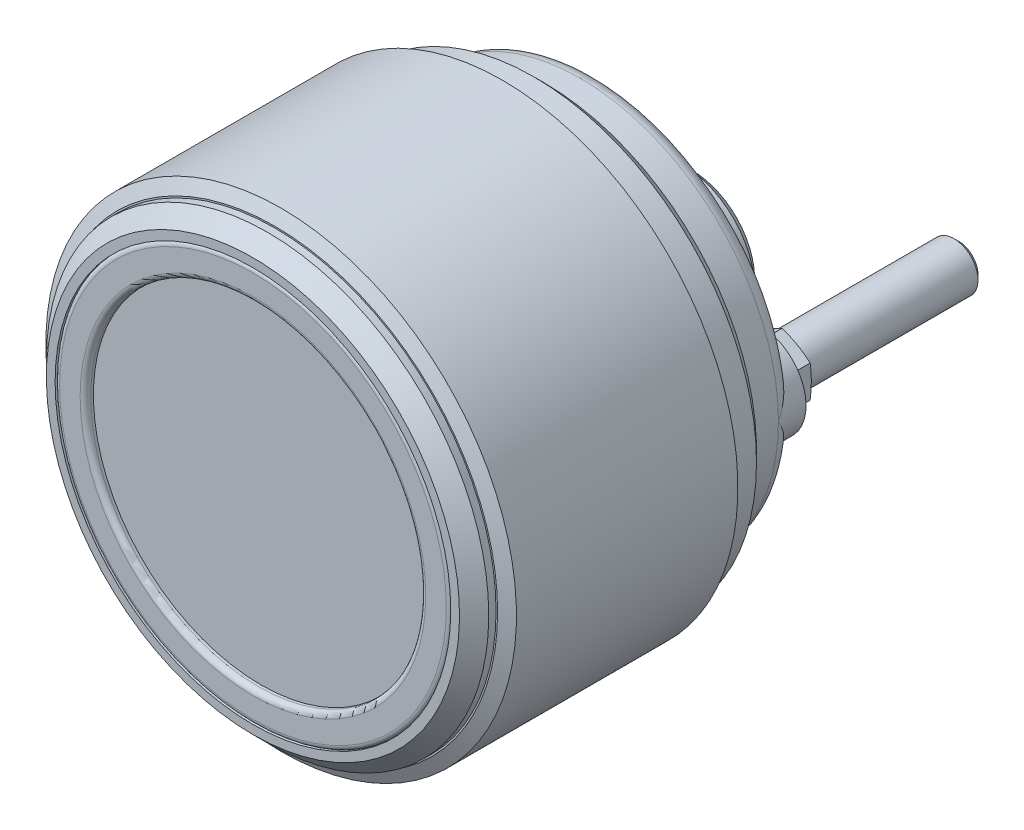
ISO-10303-21;
HEADER;
FILE_DESCRIPTION(('STEP AP214'),'2;1');
FILE_NAME('part.step','',(''),(''),'','','');
FILE_SCHEMA(('AUTOMOTIVE_DESIGN { 1 0 10303 214 1 1 1 1 }'));
ENDSEC;
DATA;
#1=APPLICATION_CONTEXT('core data for automotive mechanical design processes');
#2=APPLICATION_PROTOCOL_DEFINITION('international standard','automotive_design',2000,#1);
#3=PRODUCT_CONTEXT('',#1,'mechanical');
#4=PRODUCT('Part','Part','',(#3));
#5=PRODUCT_RELATED_PRODUCT_CATEGORY('part','',(#4));
#6=PRODUCT_DEFINITION_FORMATION('','',#4);
#7=PRODUCT_DEFINITION_CONTEXT('part definition',#1,'design');
#8=PRODUCT_DEFINITION('design','',#6,#7);
#9=PRODUCT_DEFINITION_SHAPE('','',#8);
#10=(LENGTH_UNIT() NAMED_UNIT(*) SI_UNIT(.MILLI.,.METRE.));
#11=(NAMED_UNIT(*) PLANE_ANGLE_UNIT() SI_UNIT($,.RADIAN.));
#12=(NAMED_UNIT(*) SI_UNIT($,.STERADIAN.) SOLID_ANGLE_UNIT());
#13=UNCERTAINTY_MEASURE_WITH_UNIT(LENGTH_MEASURE(1.E-05),#10,'distance_accuracy_value','');
#14=(GEOMETRIC_REPRESENTATION_CONTEXT(3) GLOBAL_UNCERTAINTY_ASSIGNED_CONTEXT((#13)) GLOBAL_UNIT_ASSIGNED_CONTEXT((#10,
#11,#12)) REPRESENTATION_CONTEXT('',''));
#15=CARTESIAN_POINT('',(0.,0.,0.));
#16=DIRECTION('',(0.,0.,1.));
#17=DIRECTION('',(1.,0.,0.));
#18=AXIS2_PLACEMENT_3D('',#15,#16,#17);
#19=CARTESIAN_POINT('',(0.,0.,54.336));
#20=DIRECTION('',(0.,0.,-1.));
#21=DIRECTION('',(0.,-1.,0.));
#22=AXIS2_PLACEMENT_3D('',#19,#20,#21);
#23=TOROIDAL_SURFACE('',#22,24.236,0.664);
#24=CARTESIAN_POINT('',(0.,0.,54.6864283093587));
#25=DIRECTION('',(0.,0.,-1.));
#26=DIRECTION('',(-1.,0.,0.));
#27=AXIS2_PLACEMENT_3D('',#24,#25,#26);
#28=CIRCLE('',#27,24.8);
#29=CARTESIAN_POINT('',(-24.8,0.,54.6864283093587));
#30=VERTEX_POINT('',#29);
#31=EDGE_CURVE('E25',#30,#30,#28,.F.);
#32=ORIENTED_EDGE('',*,*,#31,.T.);
#33=EDGE_LOOP('',(#32));
#34=FACE_BOUND('',#33,.T.);
#35=CARTESIAN_POINT('',(0.,0.,55.));
#36=DIRECTION('',(0.,0.,-1.));
#37=DIRECTION('',(0.,1.,0.));
#38=AXIS2_PLACEMENT_3D('',#35,#36,#37);
#39=CIRCLE('',#38,24.236);
#40=CARTESIAN_POINT('',(0.,24.236,55.));
#41=VERTEX_POINT('',#40);
#42=CARTESIAN_POINT('',(0.,-24.236,55.));
#43=VERTEX_POINT('',#42);
#44=EDGE_CURVE('E67',#41,#43,#39,.T.);
#45=ORIENTED_EDGE('',*,*,#44,.T.);
#46=CARTESIAN_POINT('',(0.,0.,55.));
#47=DIRECTION('',(0.,0.,-1.));
#48=DIRECTION('',(0.,-1.,0.));
#49=AXIS2_PLACEMENT_3D('',#46,#47,#48);
#50=CIRCLE('',#49,24.236);
#51=CARTESIAN_POINT('',(-24.236,0.,55.));
#52=VERTEX_POINT('',#51);
#53=EDGE_CURVE('E117',#43,#52,#50,.T.);
#54=ORIENTED_EDGE('',*,*,#53,.T.);
#55=CARTESIAN_POINT('',(0.,0.,55.));
#56=DIRECTION('',(0.,0.,-1.));
#57=DIRECTION('',(-1.,0.,0.));
#58=AXIS2_PLACEMENT_3D('',#55,#56,#57);
#59=CIRCLE('',#58,24.236);
#60=EDGE_CURVE('E115',#52,#41,#59,.T.);
#61=ORIENTED_EDGE('',*,*,#60,.T.);
#62=EDGE_LOOP('',(#45,#54,#61));
#63=FACE_BOUND('',#62,.T.);
#64=ADVANCED_FACE('F14',(#34,#63),#23,.T.);
#65=CARTESIAN_POINT('',(-22.95,0.,55.));
#66=DIRECTION('',(0.,0.,1.));
#67=DIRECTION('',(0.,1.,0.));
#68=AXIS2_PLACEMENT_3D('',#65,#66,#67);
#69=PLANE('',#68);
#70=CARTESIAN_POINT('',(0.,0.,55.));
#71=DIRECTION('',(0.,0.,1.));
#72=DIRECTION('',(0.,-1.,0.));
#73=AXIS2_PLACEMENT_3D('',#70,#71,#72);
#74=CIRCLE('',#73,21.664);
#75=CARTESIAN_POINT('',(0.,21.664,55.));
#76=VERTEX_POINT('',#75);
#77=CARTESIAN_POINT('',(0.,-21.664,55.));
#78=VERTEX_POINT('',#77);
#79=EDGE_CURVE('E57',#76,#78,#74,.F.);
#80=ORIENTED_EDGE('',*,*,#79,.T.);
#81=CARTESIAN_POINT('',(0.,0.,55.));
#82=DIRECTION('',(0.,0.,1.));
#83=DIRECTION('',(-1.,0.,0.));
#84=AXIS2_PLACEMENT_3D('',#81,#82,#83);
#85=CIRCLE('',#84,21.664);
#86=CARTESIAN_POINT('',(-21.664,0.,55.));
#87=VERTEX_POINT('',#86);
#88=EDGE_CURVE('E61',#78,#87,#85,.F.);
#89=ORIENTED_EDGE('',*,*,#88,.T.);
#90=CARTESIAN_POINT('',(0.,0.,55.));
#91=DIRECTION('',(0.,0.,1.));
#92=DIRECTION('',(0.,1.,0.));
#93=AXIS2_PLACEMENT_3D('',#90,#91,#92);
#94=CIRCLE('',#93,21.664);
#95=EDGE_CURVE('E63',#87,#76,#94,.F.);
#96=ORIENTED_EDGE('',*,*,#95,.T.);
#97=EDGE_LOOP('',(#80,#89,#96));
#98=FACE_BOUND('',#97,.T.);
#99=ORIENTED_EDGE('',*,*,#53,.F.);
#100=ORIENTED_EDGE('',*,*,#44,.F.);
#101=ORIENTED_EDGE('',*,*,#60,.F.);
#102=EDGE_LOOP('',(#99,#100,#101));
#103=FACE_BOUND('',#102,.T.);
#104=ADVANCED_FACE('F70',(#98,#103),#69,.T.);
#105=CARTESIAN_POINT('',(0.,0.,54.336));
#106=DIRECTION('',(0.,0.,-1.));
#107=DIRECTION('',(0.,-1.,0.));
#108=AXIS2_PLACEMENT_3D('',#105,#106,#107);
#109=TOROIDAL_SURFACE('',#108,21.664,0.664);
#110=CARTESIAN_POINT('',(0.,0.,54.336));
#111=DIRECTION('',(0.,0.,-1.));
#112=DIRECTION('',(0.,-1.,0.));
#113=AXIS2_PLACEMENT_3D('',#110,#111,#112);
#114=CIRCLE('',#113,21.);
#115=CARTESIAN_POINT('',(0.,-21.,54.336));
#116=VERTEX_POINT('',#115);
#117=EDGE_CURVE('E2007',#116,#116,#114,.T.);
#118=ORIENTED_EDGE('',*,*,#117,.T.);
#119=EDGE_LOOP('',(#118));
#120=FACE_BOUND('',#119,.T.);
#121=ORIENTED_EDGE('',*,*,#95,.F.);
#122=ORIENTED_EDGE('',*,*,#88,.F.);
#123=ORIENTED_EDGE('',*,*,#79,.F.);
#124=EDGE_LOOP('',(#121,#122,#123));
#125=FACE_BOUND('',#124,.T.);
#126=ADVANCED_FACE('F16',(#120,#125),#109,.T.);
#127=CARTESIAN_POINT('',(0.,0.,54.));
#128=DIRECTION('',(0.,0.,1.));
#129=DIRECTION('',(0.,1.,0.));
#130=AXIS2_PLACEMENT_3D('',#127,#128,#129);
#131=CYLINDRICAL_SURFACE('',#130,21.);
#132=CARTESIAN_POINT('',(0.,0.,54.));
#133=DIRECTION('',(0.,0.,1.));
#134=DIRECTION('',(0.,1.,0.));
#135=AXIS2_PLACEMENT_3D('',#132,#133,#134);
#136=CIRCLE('',#135,21.);
#137=CARTESIAN_POINT('',(0.,21.,54.));
#138=VERTEX_POINT('',#137);
#139=EDGE_CURVE('E2009',#138,#138,#136,.T.);
#140=ORIENTED_EDGE('',*,*,#139,.F.);
#141=EDGE_LOOP('',(#140));
#142=FACE_BOUND('',#141,.T.);
#143=ORIENTED_EDGE('',*,*,#117,.F.);
#144=EDGE_LOOP('',(#143));
#145=FACE_BOUND('',#144,.T.);
#146=ADVANCED_FACE('F493',(#142,#145),#131,.F.);
#147=CARTESIAN_POINT('',(0.,0.,54.));
#148=DIRECTION('',(0.,0.,1.));
#149=DIRECTION('',(0.,1.,0.));
#150=AXIS2_PLACEMENT_3D('',#147,#148,#149);
#151=PLANE('',#150);
#152=ORIENTED_EDGE('',*,*,#139,.T.);
#153=EDGE_LOOP('',(#152));
#154=FACE_BOUND('',#153,.T.);
#155=ADVANCED_FACE('F490',(#154),#151,.T.);
#156=CARTESIAN_POINT('',(0.,0.,24.6));
#157=DIRECTION('',(0.,0.,-1.));
#158=DIRECTION('',(0.,-1.,0.));
#159=AXIS2_PLACEMENT_3D('',#156,#157,#158);
#160=CYLINDRICAL_SURFACE('',#159,24.8);
#161=ORIENTED_EDGE('',*,*,#31,.F.);
#162=EDGE_LOOP('',(#161));
#163=FACE_BOUND('',#162,.T.);
#164=CARTESIAN_POINT('',(0.,0.,55.));
#165=DIRECTION('',(0.,0.,-1.));
#166=DIRECTION('',(0.,-1.,0.));
#167=AXIS2_PLACEMENT_3D('',#164,#165,#166);
#168=CIRCLE('',#167,24.8);
#169=CARTESIAN_POINT('',(0.,-24.8,55.));
#170=VERTEX_POINT('',#169);
#171=EDGE_CURVE('E337',#170,#170,#168,.T.);
#172=ORIENTED_EDGE('',*,*,#171,.F.);
#173=EDGE_LOOP('',(#172));
#174=FACE_BOUND('',#173,.T.);
#175=ADVANCED_FACE('F492',(#163,#174),#160,.F.);
#176=CARTESIAN_POINT('',(-25.896666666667,0.,55.));
#177=DIRECTION('',(0.,0.,1.));
#178=DIRECTION('',(0.,1.,0.));
#179=AXIS2_PLACEMENT_3D('',#176,#177,#178);
#180=PLANE('',#179);
#181=ORIENTED_EDGE('',*,*,#171,.T.);
#182=EDGE_LOOP('',(#181));
#183=FACE_BOUND('',#182,.T.);
#184=CARTESIAN_POINT('',(0.,0.,55.));
#185=DIRECTION('',(0.,0.,-1.));
#186=DIRECTION('',(0.,-1.,0.));
#187=AXIS2_PLACEMENT_3D('',#184,#185,#186);
#188=CIRCLE('',#187,25.896666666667);
#189=CARTESIAN_POINT('',(0.,-25.896666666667,55.));
#190=VERTEX_POINT('',#189);
#191=EDGE_CURVE('E1765',#190,#190,#188,.T.);
#192=ORIENTED_EDGE('',*,*,#191,.F.);
#193=EDGE_LOOP('',(#192));
#194=FACE_BOUND('',#193,.T.);
#195=ADVANCED_FACE('F501',(#183,#194),#180,.T.);
#196=CARTESIAN_POINT('',(0.,0.,53.166666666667));
#197=DIRECTION('',(0.,0.,-1.));
#198=DIRECTION('',(0.,-1.,0.));
#199=AXIS2_PLACEMENT_3D('',#196,#197,#198);
#200=CONICAL_SURFACE('',#199,27.73,0.785398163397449);
#201=ORIENTED_EDGE('',*,*,#191,.T.);
#202=EDGE_LOOP('',(#201));
#203=FACE_BOUND('',#202,.T.);
#204=CARTESIAN_POINT('',(0.,0.,53.166666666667));
#205=DIRECTION('',(0.,0.,-1.));
#206=DIRECTION('',(0.,-1.,0.));
#207=AXIS2_PLACEMENT_3D('',#204,#205,#206);
#208=CIRCLE('',#207,27.73);
#209=CARTESIAN_POINT('',(0.,-27.73,53.166666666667));
#210=VERTEX_POINT('',#209);
#211=EDGE_CURVE('E1763',#210,#210,#208,.T.);
#212=ORIENTED_EDGE('',*,*,#211,.F.);
#213=EDGE_LOOP('',(#212));
#214=FACE_BOUND('',#213,.T.);
#215=ADVANCED_FACE('F1226',(#203,#214),#200,.T.);
#216=CARTESIAN_POINT('',(0.,0.,24.6));
#217=DIRECTION('',(0.,0.,-1.));
#218=DIRECTION('',(0.,-1.,0.));
#219=AXIS2_PLACEMENT_3D('',#216,#217,#218);
#220=CYLINDRICAL_SURFACE('',#219,27.73);
#221=ORIENTED_EDGE('',*,*,#211,.T.);
#222=EDGE_LOOP('',(#221));
#223=FACE_BOUND('',#222,.T.);
#224=CARTESIAN_POINT('',(0.,0.,52.25));
#225=DIRECTION('',(0.,0.,-1.));
#226=DIRECTION('',(0.,-1.,0.));
#227=AXIS2_PLACEMENT_3D('',#224,#225,#226);
#228=CIRCLE('',#227,27.73);
#229=CARTESIAN_POINT('',(0.,-27.73,52.25));
#230=VERTEX_POINT('',#229);
#231=EDGE_CURVE('E1760',#230,#230,#228,.T.);
#232=ORIENTED_EDGE('',*,*,#231,.F.);
#233=EDGE_LOOP('',(#232));
#234=FACE_BOUND('',#233,.T.);
#235=ADVANCED_FACE('F1237',(#223,#234),#220,.T.);
#236=CARTESIAN_POINT('',(-27.926666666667,0.,52.25));
#237=DIRECTION('',(0.,0.,1.));
#238=DIRECTION('',(0.,1.,0.));
#239=AXIS2_PLACEMENT_3D('',#236,#237,#238);
#240=PLANE('',#239);
#241=ORIENTED_EDGE('',*,*,#231,.T.);
#242=EDGE_LOOP('',(#241));
#243=FACE_BOUND('',#242,.T.);
#244=CARTESIAN_POINT('',(0.,0.,52.25));
#245=DIRECTION('',(0.,0.,-1.));
#246=DIRECTION('',(0.,-1.,0.));
#247=AXIS2_PLACEMENT_3D('',#244,#245,#246);
#248=CIRCLE('',#247,27.926666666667);
#249=CARTESIAN_POINT('',(0.,-27.926666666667,52.25));
#250=VERTEX_POINT('',#249);
#251=EDGE_CURVE('E1757',#250,#250,#248,.T.);
#252=ORIENTED_EDGE('',*,*,#251,.F.);
#253=EDGE_LOOP('',(#252));
#254=FACE_BOUND('',#253,.T.);
#255=ADVANCED_FACE('F1248',(#243,#254),#240,.T.);
#256=CARTESIAN_POINT('',(0.,0.,51.464285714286));
#257=DIRECTION('',(0.,0.,-1.));
#258=DIRECTION('',(0.,-1.,0.));
#259=AXIS2_PLACEMENT_3D('',#256,#257,#258);
#260=CONICAL_SURFACE('',#259,29.5,1.10763309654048);
#261=CARTESIAN_POINT('',(0.,0.,51.464285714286));
#262=DIRECTION('',(0.,0.,-1.));
#263=DIRECTION('',(0.,-1.,0.));
#264=AXIS2_PLACEMENT_3D('',#261,#262,#263);
#265=CIRCLE('',#264,29.5);
#266=CARTESIAN_POINT('',(0.,-29.5,51.464285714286));
#267=VERTEX_POINT('',#266);
#268=EDGE_CURVE('E1754',#267,#267,#265,.T.);
#269=ORIENTED_EDGE('',*,*,#268,.F.);
#270=EDGE_LOOP('',(#269));
#271=FACE_BOUND('',#270,.T.);
#272=ORIENTED_EDGE('',*,*,#251,.T.);
#273=EDGE_LOOP('',(#272));
#274=FACE_BOUND('',#273,.T.);
#275=ADVANCED_FACE('F1259',(#271,#274),#260,.T.);
#276=CARTESIAN_POINT('',(0.,0.,24.6));
#277=DIRECTION('',(0.,0.,-1.));
#278=DIRECTION('',(0.,-1.,0.));
#279=AXIS2_PLACEMENT_3D('',#276,#277,#278);
#280=CYLINDRICAL_SURFACE('',#279,29.5);
#281=ORIENTED_EDGE('',*,*,#268,.T.);
#282=EDGE_LOOP('',(#281));
#283=FACE_BOUND('',#282,.T.);
#284=CARTESIAN_POINT('',(0.,0.,23.702380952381));
#285=DIRECTION('',(0.,0.,-1.));
#286=DIRECTION('',(0.,-1.,0.));
#287=AXIS2_PLACEMENT_3D('',#284,#285,#286);
#288=CIRCLE('',#287,29.5);
#289=CARTESIAN_POINT('',(0.,-29.5,23.702380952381));
#290=VERTEX_POINT('',#289);
#291=EDGE_CURVE('E1751',#290,#290,#288,.T.);
#292=ORIENTED_EDGE('',*,*,#291,.F.);
#293=EDGE_LOOP('',(#292));
#294=FACE_BOUND('',#293,.T.);
#295=ADVANCED_FACE('F1270',(#283,#294),#280,.T.);
#296=CARTESIAN_POINT('',(0.,0.,22.916666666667));
#297=DIRECTION('',(0.,0.,1.));
#298=DIRECTION('',(0.,1.,0.));
#299=AXIS2_PLACEMENT_3D('',#296,#297,#298);
#300=CONICAL_SURFACE('',#299,27.926666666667,1.10763309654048);
#301=ORIENTED_EDGE('',*,*,#291,.T.);
#302=EDGE_LOOP('',(#301));
#303=FACE_BOUND('',#302,.T.);
#304=CARTESIAN_POINT('',(0.,0.,22.916666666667));
#305=DIRECTION('',(0.,0.,-1.));
#306=DIRECTION('',(0.,-1.,0.));
#307=AXIS2_PLACEMENT_3D('',#304,#305,#306);
#308=CIRCLE('',#307,27.926666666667);
#309=CARTESIAN_POINT('',(0.,-27.926666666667,22.916666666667));
#310=VERTEX_POINT('',#309);
#311=EDGE_CURVE('E1748',#310,#310,#308,.T.);
#312=ORIENTED_EDGE('',*,*,#311,.F.);
#313=EDGE_LOOP('',(#312));
#314=FACE_BOUND('',#313,.T.);
#315=ADVANCED_FACE('F1183',(#303,#314),#300,.T.);
#316=CARTESIAN_POINT('',(0.,0.,24.6));
#317=DIRECTION('',(0.,0.,-1.));
#318=DIRECTION('',(0.,-1.,0.));
#319=AXIS2_PLACEMENT_3D('',#316,#317,#318);
#320=CYLINDRICAL_SURFACE('',#319,27.926666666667);
#321=CARTESIAN_POINT('',(0.,0.,19.796666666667));
#322=DIRECTION('',(0.,0.,-1.));
#323=DIRECTION('',(0.,-1.,0.));
#324=AXIS2_PLACEMENT_3D('',#321,#322,#323);
#325=CIRCLE('',#324,27.926666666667);
#326=CARTESIAN_POINT('',(0.,-27.926666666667,19.796666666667));
#327=VERTEX_POINT('',#326);
#328=EDGE_CURVE('E1743',#327,#327,#325,.T.);
#329=ORIENTED_EDGE('',*,*,#328,.F.);
#330=EDGE_LOOP('',(#329));
#331=FACE_BOUND('',#330,.T.);
#332=ORIENTED_EDGE('',*,*,#311,.T.);
#333=EDGE_LOOP('',(#332));
#334=FACE_BOUND('',#333,.T.);
#335=ADVANCED_FACE('F1177',(#331,#334),#320,.T.);
#336=CARTESIAN_POINT('',(0.,0.,18.5));
#337=DIRECTION('',(0.,0.,1.));
#338=DIRECTION('',(0.,1.,0.));
#339=AXIS2_PLACEMENT_3D('',#336,#337,#338);
#340=CONICAL_SURFACE('',#339,26.63,0.785398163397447);
#341=ORIENTED_EDGE('',*,*,#328,.T.);
#342=EDGE_LOOP('',(#341));
#343=FACE_BOUND('',#342,.T.);
#344=CARTESIAN_POINT('',(0.,0.,18.5));
#345=DIRECTION('',(0.,0.,-1.));
#346=DIRECTION('',(0.,-1.,0.));
#347=AXIS2_PLACEMENT_3D('',#344,#345,#346);
#348=CIRCLE('',#347,26.63);
#349=CARTESIAN_POINT('',(0.,-26.63,18.5));
#350=VERTEX_POINT('',#349);
#351=EDGE_CURVE('E1741',#350,#350,#348,.T.);
#352=ORIENTED_EDGE('',*,*,#351,.F.);
#353=EDGE_LOOP('',(#352));
#354=FACE_BOUND('',#353,.T.);
#355=ADVANCED_FACE('F1182',(#343,#354),#340,.T.);
#356=CARTESIAN_POINT('',(-24.839,0.,18.5));
#357=DIRECTION('',(0.,0.,-1.));
#358=DIRECTION('',(0.,-1.,0.));
#359=AXIS2_PLACEMENT_3D('',#356,#357,#358);
#360=PLANE('',#359);
#361=ORIENTED_EDGE('',*,*,#351,.T.);
#362=EDGE_LOOP('',(#361));
#363=FACE_BOUND('',#362,.T.);
#364=CARTESIAN_POINT('',(0.,0.,18.5));
#365=DIRECTION('',(0.,0.,-1.));
#366=DIRECTION('',(0.,-1.,0.));
#367=AXIS2_PLACEMENT_3D('',#364,#365,#366);
#368=CIRCLE('',#367,24.839);
#369=CARTESIAN_POINT('',(0.,-24.839,18.5));
#370=VERTEX_POINT('',#369);
#371=EDGE_CURVE('E450',#370,#370,#368,.T.);
#372=ORIENTED_EDGE('',*,*,#371,.F.);
#373=EDGE_LOOP('',(#372));
#374=FACE_BOUND('',#373,.T.);
#375=ADVANCED_FACE('F1305',(#363,#374),#360,.T.);
#376=CARTESIAN_POINT('',(0.,0.,24.6));
#377=DIRECTION('',(0.,0.,-1.));
#378=DIRECTION('',(0.,-1.,0.));
#379=AXIS2_PLACEMENT_3D('',#376,#377,#378);
#380=CYLINDRICAL_SURFACE('',#379,24.839);
#381=CARTESIAN_POINT('',(0.,0.,13.954666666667));
#382=DIRECTION('',(0.,0.,-1.));
#383=DIRECTION('',(0.,-1.,0.));
#384=AXIS2_PLACEMENT_3D('',#381,#382,#383);
#385=CIRCLE('',#384,24.839);
#386=CARTESIAN_POINT('',(24.839,0.,13.954666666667));
#387=VERTEX_POINT('',#386);
#388=EDGE_CURVE('E443',#387,#387,#385,.T.);
#389=ORIENTED_EDGE('',*,*,#388,.F.);
#390=EDGE_LOOP('',(#389));
#391=FACE_BOUND('',#390,.T.);
#392=ORIENTED_EDGE('',*,*,#371,.T.);
#393=EDGE_LOOP('',(#392));
#394=FACE_BOUND('',#393,.T.);
#395=ADVANCED_FACE('F344',(#391,#394),#380,.T.);
#396=CARTESIAN_POINT('',(0.,0.,13.9546666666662));
#397=DIRECTION('',(0.,0.,-1.));
#398=DIRECTION('',(0.,-1.,0.));
#399=AXIS2_PLACEMENT_3D('',#396,#397,#398);
#400=TOROIDAL_SURFACE('',#399,22.8723333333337,1.96666666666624);
#401=CARTESIAN_POINT('',(24.839,0.,13.9546666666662));
#402=CARTESIAN_POINT('',(24.8390000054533,-0.0051937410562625,13.952030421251));
#403=CARTESIAN_POINT('',(24.8389930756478,-0.0103876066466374,13.9493941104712));
#404=CARTESIAN_POINT('',(24.83819055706,-0.311004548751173,13.7968068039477));
#405=CARTESIAN_POINT('',(24.8149635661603,-0.606783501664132,13.6466937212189));
#406=CARTESIAN_POINT('',(24.7232957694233,-1.19439852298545,13.3514126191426));
#407=CARTESIAN_POINT('',(24.6547503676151,-1.48622387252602,13.2062568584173));
#408=CARTESIAN_POINT('',(24.470075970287,-2.0653869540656,12.9247642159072));
#409=CARTESIAN_POINT('',(24.3532326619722,-2.35258702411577,12.7885969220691));
#410=CARTESIAN_POINT('',(24.1417406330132,-2.77144212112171,12.5993282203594));
#411=CARTESIAN_POINT('',(24.0652196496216,-2.90904989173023,12.5387436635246));
#412=CARTESIAN_POINT('',(23.9000034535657,-3.17946491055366,12.4239300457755));
#413=CARTESIAN_POINT('',(23.8113126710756,-3.31227388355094,12.3696986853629));
#414=CARTESIAN_POINT('',(23.5798668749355,-3.62936649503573,12.2470839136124));
#415=CARTESIAN_POINT('',(23.4304824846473,-3.81061896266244,12.1829564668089));
#416=CARTESIAN_POINT('',(23.1880704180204,-4.07038478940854,12.1043481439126));
#417=CARTESIAN_POINT('',(23.1042290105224,-4.15493894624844,12.0810787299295));
#418=CARTESIAN_POINT('',(22.930678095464,-4.31949034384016,12.041497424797));
#419=CARTESIAN_POINT('',(22.8409703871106,-4.3994889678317,12.0251834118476));
#420=CARTESIAN_POINT('',(22.612685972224,-4.5906055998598,11.9950763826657));
#421=CARTESIAN_POINT('',(22.4708792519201,-4.69877516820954,11.9860325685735));
#422=CARTESIAN_POINT('',(22.2515100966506,-4.85072732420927,11.9895198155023));
#423=CARTESIAN_POINT('',(22.1772903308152,-4.89965359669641,11.9935222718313));
#424=CARTESIAN_POINT('',(22.0271526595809,-4.99380743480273,12.0079158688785));
#425=CARTESIAN_POINT('',(21.9512351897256,-5.03903593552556,12.0183053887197));
#426=CARTESIAN_POINT('',(21.7565679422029,-5.14914003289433,12.0538529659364));
#427=CARTESIAN_POINT('',(21.6370832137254,-5.21124529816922,12.0839790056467));
#428=CARTESIAN_POINT('',(21.3996358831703,-5.32474752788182,12.1639276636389));
#429=CARTESIAN_POINT('',(21.2816716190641,-5.37615731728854,12.2137264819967));
#430=CARTESIAN_POINT('',(21.0711192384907,-5.46032180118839,12.3250594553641));
#431=CARTESIAN_POINT('',(20.977514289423,-5.49474914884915,12.3833893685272));
#432=CARTESIAN_POINT('',(20.7989418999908,-5.55577403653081,12.5154420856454));
#433=CARTESIAN_POINT('',(20.7139712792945,-5.58237446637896,12.5891591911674));
#434=CARTESIAN_POINT('',(20.556358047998,-5.62836282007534,12.7515253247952));
#435=CARTESIAN_POINT('',(20.4837800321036,-5.64771354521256,12.8402480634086));
#436=CARTESIAN_POINT('',(20.3553595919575,-5.67990624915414,13.0302258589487));
#437=CARTESIAN_POINT('',(20.2995200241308,-5.69274711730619,13.1314830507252));
#438=CARTESIAN_POINT('',(20.2121508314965,-5.71195422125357,13.3328226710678));
#439=CARTESIAN_POINT('',(20.1787900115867,-5.71882724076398,13.4320683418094));
#440=CARTESIAN_POINT('',(20.1297854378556,-5.72871237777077,13.6348921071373));
#441=CARTESIAN_POINT('',(20.1140986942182,-5.73173386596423,13.7384590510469));
#442=CARTESIAN_POINT('',(20.1063734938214,-5.73322386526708,13.8611602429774));
#443=CARTESIAN_POINT('',(20.1054909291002,-5.73339422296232,13.8799023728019));
#444=CARTESIAN_POINT('',(20.1043169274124,-5.73362078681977,13.917383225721));
#445=CARTESIAN_POINT('',(20.1040247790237,-5.73367713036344,13.9361219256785));
#446=CARTESIAN_POINT('',(20.1040257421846,-5.7336766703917,13.954866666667));
#447=B_SPLINE_CURVE_WITH_KNOTS('',3,(#401,#402,#403,#404,#405,#406,#407,#408,#409,#410,#411,
#412,#413,#414,#415,#416,#417,#418,#419,#420,#421,#422,#423,#424,#425,#426,#427,#428,#429,#430,
#431,#432,#433,#434,#435,#436,#437,#438,#439,#440,#441,#442,#443,#444,#445,#446),.UNSPECIFIED.,
.F.,.F.,(4,2,2,2,2,2,2,2,2,2,2,2,2,2,2,2,2,2,2,2,2,2,4),(0.,0.0174738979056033,1.0113543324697,
2.00753671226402,3.0190117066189,3.52459743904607,4.02999960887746,4.75753278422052,
5.12115451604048,5.48466524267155,6.01822164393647,6.28490953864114,6.55152978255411,
6.96385282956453,7.37567857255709,7.72084475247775,8.06588333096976,8.41266883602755,
8.75951348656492,9.07275214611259,9.3852272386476,9.4415147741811,9.49773444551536),.UNSPECIFIED.);
#448=CARTESIAN_POINT('',(22.3697292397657,-4.76852659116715,11.988));
#449=VERTEX_POINT('',#448);
#450=EDGE_CURVE('E330',#387,#449,#447,.T.);
#451=ORIENTED_EDGE('',*,*,#450,.F.);
#452=ORIENTED_EDGE('',*,*,#388,.T.);
#453=CARTESIAN_POINT('',(20.1040257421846,5.73367667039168,13.954866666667));
#454=CARTESIAN_POINT('',(20.1040130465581,5.7336740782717,13.904738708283));
#455=CARTESIAN_POINT('',(20.1061231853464,5.73327267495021,13.8546134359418));
#456=CARTESIAN_POINT('',(20.1145351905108,5.7316460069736,13.7547357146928));
#457=CARTESIAN_POINT('',(20.1208365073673,5.73042085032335,13.7049832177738));
#458=CARTESIAN_POINT('',(20.1375586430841,5.72712405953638,13.6063132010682));
#459=CARTESIAN_POINT('',(20.1479704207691,5.72505428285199,13.5573940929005));
#460=CARTESIAN_POINT('',(20.1727956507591,5.72002015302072,13.460643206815));
#461=CARTESIAN_POINT('',(20.1872091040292,5.71705579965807,13.4128114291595));
#462=CARTESIAN_POINT('',(20.2362591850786,5.7067255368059,13.2714395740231));
#463=CARTESIAN_POINT('',(20.2767185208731,5.69792012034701,13.1799474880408));
#464=CARTESIAN_POINT('',(20.3714416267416,5.67586253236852,13.0050882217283));
#465=CARTESIAN_POINT('',(20.4257059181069,5.66261019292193,12.9217213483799));
#466=CARTESIAN_POINT('',(20.5469846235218,5.63069737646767,12.7634083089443));
#467=CARTESIAN_POINT('',(20.614224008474,5.61193786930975,12.6886547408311));
#468=CARTESIAN_POINT('',(20.7580105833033,5.56856828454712,12.55072436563));
#469=CARTESIAN_POINT('',(20.8345606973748,5.54395636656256,12.4875512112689));
#470=CARTESIAN_POINT('',(21.0004177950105,5.48639568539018,12.3687644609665));
#471=CARTESIAN_POINT('',(21.0902547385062,5.45294246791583,12.3141401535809));
#472=CARTESIAN_POINT('',(21.2741632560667,5.3788412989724,12.2186420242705));
#473=CARTESIAN_POINT('',(21.3682370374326,5.33818956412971,12.1777754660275));
#474=CARTESIAN_POINT('',(21.530514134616,5.26269751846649,12.1187844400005));
#475=CARTESIAN_POINT('',(21.5983870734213,5.22954178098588,12.0974992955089));
#476=CARTESIAN_POINT('',(21.7340630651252,5.15990765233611,12.0609728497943));
#477=CARTESIAN_POINT('',(21.8018660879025,5.12342817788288,12.0457335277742));
#478=CARTESIAN_POINT('',(22.0043345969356,5.0091744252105,12.008321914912));
#479=CARTESIAN_POINT('',(22.1379396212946,4.92664006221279,11.994497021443));
#480=CARTESIAN_POINT('',(22.3564660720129,4.77907122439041,11.986644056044));
#481=CARTESIAN_POINT('',(22.4432678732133,4.71690481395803,11.9876915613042));
#482=CARTESIAN_POINT('',(22.6131138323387,4.58810250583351,11.9970784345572));
#483=CARTESIAN_POINT('',(22.6961567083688,4.52146510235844,12.0054202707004));
#484=CARTESIAN_POINT('',(22.9389841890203,4.31547477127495,12.0398701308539));
#485=CARTESIAN_POINT('',(23.0924121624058,4.17008133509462,12.0754031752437));
#486=CARTESIAN_POINT('',(23.335787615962,3.91355426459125,12.1511699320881));
#487=CARTESIAN_POINT('',(23.4307640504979,3.80560448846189,12.186612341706));
#488=CARTESIAN_POINT('',(23.6113922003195,3.58459810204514,12.264748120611));
#489=CARTESIAN_POINT('',(23.697040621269,3.47153970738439,12.3074440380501));
#490=CARTESIAN_POINT('',(23.9400264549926,3.12561689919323,12.4444372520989));
#491=CARTESIAN_POINT('',(24.08325238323,2.88616719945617,12.5475883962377));
#492=CARTESIAN_POINT('',(24.2874026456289,2.48364094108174,12.7293156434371));
#493=CARTESIAN_POINT('',(24.3594261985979,2.32395073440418,12.8034490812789));
#494=CARTESIAN_POINT('',(24.4882798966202,2.00074075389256,12.9564730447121));
#495=CARTESIAN_POINT('',(24.5451075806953,1.83722036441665,13.0353643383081));
#496=CARTESIAN_POINT('',(24.6928514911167,1.34292546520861,13.2768952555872));
#497=CARTESIAN_POINT('',(24.7613823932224,1.00770766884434,13.4447206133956));
#498=CARTESIAN_POINT('',(24.8255505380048,0.45278300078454,13.7248602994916));
#499=CARTESIAN_POINT('',(24.8383961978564,0.234153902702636,13.8358148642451));
#500=CARTESIAN_POINT('',(24.8389930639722,0.0103876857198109,13.949394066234));
#501=CARTESIAN_POINT('',(24.8389999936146,0.00519382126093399,13.952030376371));
#502=CARTESIAN_POINT('',(24.839,0.,13.9546666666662));
#503=B_SPLINE_CURVE_WITH_KNOTS('',3,(#453,#454,#455,#456,#457,#458,#459,#460,#461,#462,#463,
#464,#465,#466,#467,#468,#469,#470,#471,#472,#473,#474,#475,#476,#477,#478,#479,#480,#481,#482,
#483,#484,#485,#486,#487,#488,#489,#490,#491,#492,#493,#494,#495,#496,#497,#498,#499,#500,#501,
#502),.UNSPECIFIED.,.F.,.F.,(4,2,2,2,2,2,2,2,2,2,2,2,2,2,2,2,2,2,2,2,2,2,2,2,4),(0.,
0.150332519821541,0.300645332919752,0.450629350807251,0.600613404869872,0.900354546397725,
1.20010700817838,1.50561956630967,1.81122832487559,2.1409421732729,2.47082982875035,
2.70596428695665,2.94117565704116,3.41200794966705,3.73195407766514,4.05200850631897,
4.69231600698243,5.13606736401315,5.57997493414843,6.46846683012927,7.03851355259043,
7.60865253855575,8.74638711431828,9.481732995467,9.4992068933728),.UNSPECIFIED.);
#504=CARTESIAN_POINT('',(22.3697292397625,4.76852659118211,11.988));
#505=VERTEX_POINT('',#504);
#506=EDGE_CURVE('E321',#505,#387,#503,.T.);
#507=ORIENTED_EDGE('',*,*,#506,.F.);
#508=CARTESIAN_POINT('',(0.,0.,11.988));
#509=DIRECTION('',(0.,0.,-1.));
#510=DIRECTION('',(0.,-1.,0.));
#511=AXIS2_PLACEMENT_3D('',#508,#509,#510);
#512=CIRCLE('',#511,22.872333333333);
#513=EDGE_CURVE('E441',#449,#505,#512,.T.);
#514=ORIENTED_EDGE('',*,*,#513,.F.);
#515=EDGE_LOOP('',(#451,#452,#507,#514));
#516=FACE_BOUND('',#515,.T.);
#517=ADVANCED_FACE('F317',(#516),#400,.T.);
#518=CARTESIAN_POINT('',(19.,0.,15.5));
#519=DIRECTION('',(0.,0.,-1.));
#520=DIRECTION('',(0.,-1.,0.));
#521=AXIS2_PLACEMENT_3D('',#518,#519,#520);
#522=CYLINDRICAL_SURFACE('',#521,5.839);
#523=CARTESIAN_POINT('',(19.,0.,11.988));
#524=DIRECTION('',(0.,0.,-1.));
#525=DIRECTION('',(0.,-1.,0.));
#526=AXIS2_PLACEMENT_3D('',#523,#524,#525);
#527=CIRCLE('',#526,5.839);
#528=EDGE_CURVE('E338',#449,#505,#527,.T.);
#529=ORIENTED_EDGE('',*,*,#528,.T.);
#530=ORIENTED_EDGE('',*,*,#506,.T.);
#531=ORIENTED_EDGE('',*,*,#450,.T.);
#532=EDGE_LOOP('',(#529,#530,#531));
#533=FACE_BOUND('',#532,.T.);
#534=CARTESIAN_POINT('',(19.,0.,10.5));
#535=DIRECTION('',(0.,0.,-1.));
#536=DIRECTION('',(0.,-1.,0.));
#537=AXIS2_PLACEMENT_3D('',#534,#535,#536);
#538=CIRCLE('',#537,5.839);
#539=CARTESIAN_POINT('',(19.,-5.839,10.5));
#540=VERTEX_POINT('',#539);
#541=EDGE_CURVE('E406',#540,#540,#538,.T.);
#542=ORIENTED_EDGE('',*,*,#541,.F.);
#543=EDGE_LOOP('',(#542));
#544=FACE_BOUND('',#543,.T.);
#545=ADVANCED_FACE('F312',(#533,#544),#522,.T.);
#546=CARTESIAN_POINT('',(-10.8,0.,11.988));
#547=DIRECTION('',(0.,0.,-1.));
#548=DIRECTION('',(0.,-1.,0.));
#549=AXIS2_PLACEMENT_3D('',#546,#547,#548);
#550=PLANE('',#549);
#551=ORIENTED_EDGE('',*,*,#513,.T.);
#552=ORIENTED_EDGE('',*,*,#528,.F.);
#553=EDGE_LOOP('',(#551,#552));
#554=FACE_BOUND('',#553,.T.);
#555=CARTESIAN_POINT('',(0.,0.,11.988));
#556=DIRECTION('',(0.,0.,-1.));
#557=DIRECTION('',(0.,-1.,0.));
#558=AXIS2_PLACEMENT_3D('',#555,#556,#557);
#559=CIRCLE('',#558,10.8);
#560=CARTESIAN_POINT('',(0.,-10.8,11.988));
#561=VERTEX_POINT('',#560);
#562=EDGE_CURVE('E445',#561,#561,#559,.T.);
#563=ORIENTED_EDGE('',*,*,#562,.F.);
#564=EDGE_LOOP('',(#563));
#565=FACE_BOUND('',#564,.T.);
#566=ADVANCED_FACE('F316',(#554,#565),#550,.T.);
#567=CARTESIAN_POINT('',(15.5,0.,10.5));
#568=DIRECTION('',(0.,0.,-1.));
#569=DIRECTION('',(0.,-1.,0.));
#570=AXIS2_PLACEMENT_3D('',#567,#568,#569);
#571=PLANE('',#570);
#572=CARTESIAN_POINT('',(19.,0.,10.5));
#573=DIRECTION('',(0.,0.,-1.));
#574=DIRECTION('',(0.,-1.,0.));
#575=AXIS2_PLACEMENT_3D('',#572,#573,#574);
#576=CIRCLE('',#575,3.5);
#577=CARTESIAN_POINT('',(20.75,3.03108891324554,10.5));
#578=VERTEX_POINT('',#577);
#579=CARTESIAN_POINT('',(22.5,0.,10.5));
#580=VERTEX_POINT('',#579);
#581=EDGE_CURVE('E921',#578,#580,#576,.T.);
#582=ORIENTED_EDGE('',*,*,#581,.F.);
#583=CARTESIAN_POINT('',(17.25,3.03108891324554,10.5));
#584=VERTEX_POINT('',#583);
#585=EDGE_CURVE('E926',#584,#578,#576,.T.);
#586=ORIENTED_EDGE('',*,*,#585,.F.);
#587=CARTESIAN_POINT('',(15.5,0.,10.5));
#588=VERTEX_POINT('',#587);
#589=EDGE_CURVE('E414',#588,#584,#576,.T.);
#590=ORIENTED_EDGE('',*,*,#589,.F.);
#591=CARTESIAN_POINT('',(17.25,-3.03108891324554,10.5));
#592=VERTEX_POINT('',#591);
#593=EDGE_CURVE('E410',#592,#588,#576,.T.);
#594=ORIENTED_EDGE('',*,*,#593,.F.);
#595=CARTESIAN_POINT('',(20.75,-3.03108891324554,10.5));
#596=VERTEX_POINT('',#595);
#597=EDGE_CURVE('E409',#596,#592,#576,.T.);
#598=ORIENTED_EDGE('',*,*,#597,.F.);
#599=EDGE_CURVE('E927',#580,#596,#576,.T.);
#600=ORIENTED_EDGE('',*,*,#599,.F.);
#601=EDGE_LOOP('',(#582,#586,#590,#594,#598,#600));
#602=FACE_BOUND('',#601,.T.);
#603=ORIENTED_EDGE('',*,*,#541,.T.);
#604=EDGE_LOOP('',(#603));
#605=FACE_BOUND('',#604,.T.);
#606=ADVANCED_FACE('F251',(#602,#605),#571,.T.);
#607=CARTESIAN_POINT('',(0.,0.,24.6));
#608=DIRECTION('',(0.,0.,-1.));
#609=DIRECTION('',(0.,-1.,0.));
#610=AXIS2_PLACEMENT_3D('',#607,#608,#609);
#611=CYLINDRICAL_SURFACE('',#610,10.8);
#612=ORIENTED_EDGE('',*,*,#562,.T.);
#613=EDGE_LOOP('',(#612));
#614=FACE_BOUND('',#613,.T.);
#615=CARTESIAN_POINT('',(0.,0.,10.693));
#616=DIRECTION('',(0.,0.,-1.));
#617=DIRECTION('',(0.,-1.,0.));
#618=AXIS2_PLACEMENT_3D('',#615,#616,#617);
#619=CIRCLE('',#618,10.8);
#620=CARTESIAN_POINT('',(0.,-10.8,10.693));
#621=VERTEX_POINT('',#620);
#622=EDGE_CURVE('E448',#621,#621,#619,.T.);
#623=ORIENTED_EDGE('',*,*,#622,.F.);
#624=EDGE_LOOP('',(#623));
#625=FACE_BOUND('',#624,.T.);
#626=ADVANCED_FACE('F248',(#614,#625),#611,.T.);
#627=CARTESIAN_POINT('',(19.,0.,10.354637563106));
#628=DIRECTION('',(0.,0.,-1.));
#629=DIRECTION('',(0.,-1.,0.));
#630=AXIS2_PLACEMENT_3D('',#627,#628,#629);
#631=CONICAL_SURFACE('',#630,4.0425,1.30899693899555);
#632=CARTESIAN_POINT('',(22.5,5.34252563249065,9.72645561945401));
#633=CARTESIAN_POINT('',(22.5,5.18377511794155,9.762027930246));
#634=CARTESIAN_POINT('',(22.5,5.02492529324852,9.79716402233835));
#635=CARTESIAN_POINT('',(22.5,4.70697808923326,9.86632999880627));
#636=CARTESIAN_POINT('',(22.5,4.54788069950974,9.9003598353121));
#637=CARTESIAN_POINT('',(22.5,4.22924649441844,9.96710923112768));
#638=CARTESIAN_POINT('',(22.5,4.06970940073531,9.99982746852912));
#639=CARTESIAN_POINT('',(22.5,3.75030347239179,10.063593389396));
#640=CARTESIAN_POINT('',(22.5,3.59043464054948,10.0946410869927));
#641=CARTESIAN_POINT('',(22.5,3.11280482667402,10.1842401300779));
#642=CARTESIAN_POINT('',(22.5,2.79447024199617,10.2397933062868));
#643=CARTESIAN_POINT('',(22.5,2.15585851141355,10.3385753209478));
#644=CARTESIAN_POINT('',(22.5,1.83558171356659,10.3818063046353));
#645=CARTESIAN_POINT('',(22.5,1.35187655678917,10.4332664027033));
#646=CARTESIAN_POINT('',(22.5,1.18916821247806,10.4482343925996));
#647=CARTESIAN_POINT('',(22.5,0.863341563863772,10.4727982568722));
#648=CARTESIAN_POINT('',(22.5,0.700223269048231,10.4823942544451));
#649=CARTESIAN_POINT('',(22.5,0.373815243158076,10.4956559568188));
#650=CARTESIAN_POINT('',(22.5,0.210525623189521,10.4993243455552));
#651=CARTESIAN_POINT('',(22.5,-0.116076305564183,10.5005049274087));
#652=CARTESIAN_POINT('',(22.5,-0.279388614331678,10.4980171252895));
#653=CARTESIAN_POINT('',(22.5,-0.606398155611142,10.487025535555));
#654=CARTESIAN_POINT('',(22.5,-0.770094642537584,10.4785000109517));
#655=CARTESIAN_POINT('',(22.5,-1.09710741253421,10.4559186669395));
#656=CARTESIAN_POINT('',(22.5,-1.26042367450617,10.4418625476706));
#657=CARTESIAN_POINT('',(22.5,-1.58666725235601,10.4089309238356));
#658=CARTESIAN_POINT('',(22.5,-1.74959425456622,10.3900523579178));
#659=CARTESIAN_POINT('',(22.5,-2.07492269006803,10.3482553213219));
#660=CARTESIAN_POINT('',(22.5,-2.23732412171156,10.3253368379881));
#661=CARTESIAN_POINT('',(22.5,-2.70200593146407,10.2549457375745));
#662=CARTESIAN_POINT('',(22.5,-3.00366524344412,10.2033930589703));
#663=CARTESIAN_POINT('',(22.5,-3.60558071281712,10.0926626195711));
#664=CARTESIAN_POINT('',(22.5,-3.90583668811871,10.0334838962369));
#665=CARTESIAN_POINT('',(22.5,-4.50536107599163,9.91000469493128));
#666=CARTESIAN_POINT('',(22.5,-4.80462923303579,9.84570298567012));
#667=CARTESIAN_POINT('',(22.5,-5.40237075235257,9.71361301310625));
#668=CARTESIAN_POINT('',(22.5,-5.70084415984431,9.64582495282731));
#669=CARTESIAN_POINT('',(22.5,-6.29429119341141,9.50847613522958));
#670=CARTESIAN_POINT('',(22.5,-6.58927038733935,9.43893934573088));
#671=CARTESIAN_POINT('',(22.5,-7.17881722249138,9.29812379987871));
#672=CARTESIAN_POINT('',(22.5,-7.47338485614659,9.22684501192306));
#673=CARTESIAN_POINT('',(22.5,-8.06184299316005,9.08308894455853));
#674=CARTESIAN_POINT('',(22.5,-8.35573388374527,9.01061324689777));
#675=CARTESIAN_POINT('',(22.5,-8.94325955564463,8.86467145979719));
#676=CARTESIAN_POINT('',(22.5,-9.2368943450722,8.79120540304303));
#677=CARTESIAN_POINT('',(22.5,-9.5304398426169,8.71738846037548));
#678=B_SPLINE_CURVE_WITH_KNOTS('',3,(#632,#633,#634,#635,#636,#637,#638,#639,#640,#641,#642,
#643,#644,#645,#646,#647,#648,#649,#650,#651,#652,#653,#654,#655,#656,#657,#658,#659,#660,#661,
#662,#663,#664,#665,#666,#667,#668,#669,#670,#671,#672,#673,#674,#675,#676,#677),.UNSPECIFIED.,
.F.,.F.,(4,2,2,2,2,2,2,2,2,2,2,2,2,2,2,2,2,2,2,2,2,2,4),(0.,0.488063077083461,0.976147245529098,
1.46471156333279,1.95327174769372,2.92256990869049,3.89169921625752,4.38181113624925,
4.87191181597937,5.36179052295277,5.85166885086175,6.34331986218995,6.83499753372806,
7.32698810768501,7.81898022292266,8.7369063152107,9.65494837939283,10.5732117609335,
11.491421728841,12.4006080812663,13.3098109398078,14.2178956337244,15.1259504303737),.UNSPECIFIED.);
#679=CARTESIAN_POINT('',(22.5,2.0207259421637,10.354918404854));
#680=VERTEX_POINT('',#679);
#681=EDGE_CURVE('E220',#580,#680,#678,.F.);
#682=ORIENTED_EDGE('',*,*,#681,.T.);
#683=CARTESIAN_POINT('',(22.5002,2.02061047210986,10.3548874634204));
#684=CARTESIAN_POINT('',(22.3548372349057,2.10453570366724,10.3773855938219));
#685=CARTESIAN_POINT('',(22.2092108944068,2.18861311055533,10.3978102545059));
#686=CARTESIAN_POINT('',(21.9174438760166,2.35706487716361,10.4336945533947));
#687=CARTESIAN_POINT('',(21.7713030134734,2.44143934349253,10.4491521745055));
#688=CARTESIAN_POINT('',(21.4793930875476,2.60997361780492,10.4741999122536));
#689=CARTESIAN_POINT('',(21.333625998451,2.69413228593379,10.4838199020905));
#690=CARTESIAN_POINT('',(21.0419059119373,2.86255695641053,10.4967193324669));
#691=CARTESIAN_POINT('',(20.8959529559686,2.94682293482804,10.5));
#692=CARTESIAN_POINT('',(20.6040470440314,3.11535489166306,10.5));
#693=CARTESIAN_POINT('',(20.4580940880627,3.19962087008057,10.4967193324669));
#694=CARTESIAN_POINT('',(20.166374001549,3.36804554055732,10.4838199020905));
#695=CARTESIAN_POINT('',(20.0206069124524,3.45220420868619,10.4741999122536));
#696=CARTESIAN_POINT('',(19.7286969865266,3.62073848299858,10.4491521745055));
#697=CARTESIAN_POINT('',(19.5825561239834,3.7051129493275,10.4336945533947));
#698=CARTESIAN_POINT('',(19.2907891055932,3.87356471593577,10.3978102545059));
#699=CARTESIAN_POINT('',(19.1451627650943,3.95764212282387,10.3773855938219));
#700=CARTESIAN_POINT('',(18.9998,4.04156735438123,10.3548874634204));
#701=B_SPLINE_CURVE_WITH_KNOTS('',3,(#683,#684,#685,#686,#687,#688,#689,#690,#691,#692,#693,
#694,#695,#696,#697,#698,#699,#700),.UNSPECIFIED.,.F.,.F.,(4,2,2,2,2,2,2,2,4),(0.,
0.50808124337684,1.01636855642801,1.52203235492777,2.02759827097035,2.53316418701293,
3.03882798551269,3.54711529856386,4.0551965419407),.UNSPECIFIED.);
#702=EDGE_CURVE('E405',#680,#578,#701,.T.);
#703=ORIENTED_EDGE('',*,*,#702,.T.);
#704=ORIENTED_EDGE('',*,*,#581,.T.);
#705=EDGE_LOOP('',(#682,#703,#704));
#706=FACE_BOUND('',#705,.T.);
#707=ADVANCED_FACE('F243',(#706),#631,.T.);
#708=ORIENTED_EDGE('',*,*,#585,.T.);
#709=CARTESIAN_POINT('',(19.,4.0414518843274,10.354918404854));
#710=VERTEX_POINT('',#709);
#711=EDGE_CURVE('E391',#578,#710,#701,.T.);
#712=ORIENTED_EDGE('',*,*,#711,.T.);
#713=CARTESIAN_POINT('',(19.0002,4.04156735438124,10.3548874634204));
#714=CARTESIAN_POINT('',(18.8548372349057,3.95764212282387,10.3773855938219));
#715=CARTESIAN_POINT('',(18.7092108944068,3.87356471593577,10.3978102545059));
#716=CARTESIAN_POINT('',(18.4174438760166,3.70511294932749,10.4336945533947));
#717=CARTESIAN_POINT('',(18.2713030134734,3.62073848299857,10.4491521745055));
#718=CARTESIAN_POINT('',(17.9793930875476,3.45220420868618,10.4741999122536));
#719=CARTESIAN_POINT('',(17.833625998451,3.36804554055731,10.4838199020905));
#720=CARTESIAN_POINT('',(17.5419059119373,3.19962087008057,10.4967193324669));
#721=CARTESIAN_POINT('',(17.3959529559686,3.11535489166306,10.5));
#722=CARTESIAN_POINT('',(17.1040470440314,2.94682293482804,10.5));
#723=CARTESIAN_POINT('',(16.9580940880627,2.86255695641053,10.4967193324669));
#724=CARTESIAN_POINT('',(16.666374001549,2.69413228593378,10.4838199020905));
#725=CARTESIAN_POINT('',(16.5206069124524,2.60997361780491,10.4741999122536));
#726=CARTESIAN_POINT('',(16.2286969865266,2.44143934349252,10.4491521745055));
#727=CARTESIAN_POINT('',(16.0825561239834,2.3570648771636,10.4336945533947));
#728=CARTESIAN_POINT('',(15.7907891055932,2.18861311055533,10.3978102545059));
#729=CARTESIAN_POINT('',(15.6451627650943,2.10453570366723,10.3773855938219));
#730=CARTESIAN_POINT('',(15.4998,2.02061047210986,10.3548874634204));
#731=B_SPLINE_CURVE_WITH_KNOTS('',3,(#713,#714,#715,#716,#717,#718,#719,#720,#721,#722,#723,
#724,#725,#726,#727,#728,#729,#730),.UNSPECIFIED.,.F.,.F.,(4,2,2,2,2,2,2,2,4),(0.,
0.50808124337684,1.01636855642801,1.52203235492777,2.02759827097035,2.53316418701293,
3.0388279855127,3.54711529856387,4.0551965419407),.UNSPECIFIED.);
#732=EDGE_CURVE('E293',#710,#584,#731,.T.);
#733=ORIENTED_EDGE('',*,*,#732,.T.);
#734=EDGE_LOOP('',(#708,#712,#733));
#735=FACE_BOUND('',#734,.T.);
#736=ADVANCED_FACE('F247',(#735),#631,.T.);
#737=ORIENTED_EDGE('',*,*,#589,.T.);
#738=CARTESIAN_POINT('',(15.5,2.0207259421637,10.354918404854));
#739=VERTEX_POINT('',#738);
#740=EDGE_CURVE('E285',#584,#739,#731,.T.);
#741=ORIENTED_EDGE('',*,*,#740,.T.);
#742=CARTESIAN_POINT('',(15.5,5.34252563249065,9.72645561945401));
#743=CARTESIAN_POINT('',(15.5,5.18377511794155,9.762027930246));
#744=CARTESIAN_POINT('',(15.5,5.02492529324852,9.79716402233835));
#745=CARTESIAN_POINT('',(15.5,4.70697808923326,9.86632999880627));
#746=CARTESIAN_POINT('',(15.5,4.54788069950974,9.9003598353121));
#747=CARTESIAN_POINT('',(15.5,4.22924649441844,9.96710923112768));
#748=CARTESIAN_POINT('',(15.5,4.06970940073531,9.99982746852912));
#749=CARTESIAN_POINT('',(15.5,3.75030347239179,10.063593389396));
#750=CARTESIAN_POINT('',(15.5,3.59043464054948,10.0946410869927));
#751=CARTESIAN_POINT('',(15.5,3.11280482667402,10.1842401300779));
#752=CARTESIAN_POINT('',(15.5,2.79447024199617,10.2397933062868));
#753=CARTESIAN_POINT('',(15.5,2.15585851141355,10.3385753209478));
#754=CARTESIAN_POINT('',(15.5,1.83558171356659,10.3818063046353));
#755=CARTESIAN_POINT('',(15.5,1.35187655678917,10.4332664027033));
#756=CARTESIAN_POINT('',(15.5,1.18916821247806,10.4482343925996));
#757=CARTESIAN_POINT('',(15.5,0.863341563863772,10.4727982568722));
#758=CARTESIAN_POINT('',(15.5,0.700223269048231,10.4823942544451));
#759=CARTESIAN_POINT('',(15.5,0.373815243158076,10.4956559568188));
#760=CARTESIAN_POINT('',(15.5,0.210525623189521,10.4993243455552));
#761=CARTESIAN_POINT('',(15.5,-0.116076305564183,10.5005049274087));
#762=CARTESIAN_POINT('',(15.5,-0.279388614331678,10.4980171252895));
#763=CARTESIAN_POINT('',(15.5,-0.606398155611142,10.487025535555));
#764=CARTESIAN_POINT('',(15.5,-0.770094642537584,10.4785000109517));
#765=CARTESIAN_POINT('',(15.5,-1.09710741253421,10.4559186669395));
#766=CARTESIAN_POINT('',(15.5,-1.26042367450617,10.4418625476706));
#767=CARTESIAN_POINT('',(15.5,-1.58666725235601,10.4089309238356));
#768=CARTESIAN_POINT('',(15.5,-1.74959425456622,10.3900523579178));
#769=CARTESIAN_POINT('',(15.5,-2.07492269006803,10.3482553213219));
#770=CARTESIAN_POINT('',(15.5,-2.23732412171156,10.3253368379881));
#771=CARTESIAN_POINT('',(15.5,-2.70200593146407,10.2549457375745));
#772=CARTESIAN_POINT('',(15.5,-3.00366524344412,10.2033930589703));
#773=CARTESIAN_POINT('',(15.5,-3.60558071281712,10.0926626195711));
#774=CARTESIAN_POINT('',(15.5,-3.90583668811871,10.0334838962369));
#775=CARTESIAN_POINT('',(15.5,-4.50536107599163,9.91000469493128));
#776=CARTESIAN_POINT('',(15.5,-4.80462923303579,9.84570298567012));
#777=CARTESIAN_POINT('',(15.5,-5.40237075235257,9.71361301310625));
#778=CARTESIAN_POINT('',(15.5,-5.70084415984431,9.64582495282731));
#779=CARTESIAN_POINT('',(15.5,-6.29429119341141,9.50847613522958));
#780=CARTESIAN_POINT('',(15.5,-6.58927038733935,9.43893934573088));
#781=CARTESIAN_POINT('',(15.5,-7.17881722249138,9.29812379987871));
#782=CARTESIAN_POINT('',(15.5,-7.47338485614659,9.22684501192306));
#783=CARTESIAN_POINT('',(15.5,-8.06184299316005,9.08308894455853));
#784=CARTESIAN_POINT('',(15.5,-8.35573388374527,9.01061324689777));
#785=CARTESIAN_POINT('',(15.5,-8.94325955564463,8.86467145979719));
#786=CARTESIAN_POINT('',(15.5,-9.2368943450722,8.79120540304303));
#787=CARTESIAN_POINT('',(15.5,-9.5304398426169,8.71738846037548));
#788=B_SPLINE_CURVE_WITH_KNOTS('',3,(#742,#743,#744,#745,#746,#747,#748,#749,#750,#751,#752,
#753,#754,#755,#756,#757,#758,#759,#760,#761,#762,#763,#764,#765,#766,#767,#768,#769,#770,#771,
#772,#773,#774,#775,#776,#777,#778,#779,#780,#781,#782,#783,#784,#785,#786,#787),.UNSPECIFIED.,
.F.,.F.,(4,2,2,2,2,2,2,2,2,2,2,2,2,2,2,2,2,2,2,2,2,2,4),(0.,0.488063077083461,0.976147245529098,
1.46471156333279,1.95327174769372,2.92256990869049,3.89169921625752,4.38181113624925,
4.87191181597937,5.36179052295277,5.85166885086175,6.34331986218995,6.83499753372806,
7.32698810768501,7.81898022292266,8.7369063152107,9.65494837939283,10.5732117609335,
11.491421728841,12.4006080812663,13.3098109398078,14.2178956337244,15.1259504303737),.UNSPECIFIED.);
#789=EDGE_CURVE('E1028',#739,#588,#788,.T.);
#790=ORIENTED_EDGE('',*,*,#789,.T.);
#791=EDGE_LOOP('',(#737,#741,#790));
#792=FACE_BOUND('',#791,.T.);
#793=ADVANCED_FACE('F1017',(#792),#631,.T.);
#794=ORIENTED_EDGE('',*,*,#593,.T.);
#795=CARTESIAN_POINT('',(15.5,-2.0207259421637,10.354918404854));
#796=VERTEX_POINT('',#795);
#797=EDGE_CURVE('E277',#588,#796,#788,.T.);
#798=ORIENTED_EDGE('',*,*,#797,.T.);
#799=CARTESIAN_POINT('',(15.4998,-2.02061047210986,10.3548874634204));
#800=CARTESIAN_POINT('',(15.6451627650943,-2.10453570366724,10.3773855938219));
#801=CARTESIAN_POINT('',(15.7907891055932,-2.18861311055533,10.3978102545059));
#802=CARTESIAN_POINT('',(16.0825561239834,-2.35706487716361,10.4336945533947));
#803=CARTESIAN_POINT('',(16.2286969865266,-2.44143934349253,10.4491521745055));
#804=CARTESIAN_POINT('',(16.5206069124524,-2.60997361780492,10.4741999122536));
#805=CARTESIAN_POINT('',(16.666374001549,-2.69413228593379,10.4838199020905));
#806=CARTESIAN_POINT('',(16.9580940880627,-2.86255695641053,10.4967193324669));
#807=CARTESIAN_POINT('',(17.1040470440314,-2.94682293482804,10.5));
#808=CARTESIAN_POINT('',(17.3959529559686,-3.11535489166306,10.5));
#809=CARTESIAN_POINT('',(17.5419059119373,-3.19962087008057,10.4967193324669));
#810=CARTESIAN_POINT('',(17.833625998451,-3.36804554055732,10.4838199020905));
#811=CARTESIAN_POINT('',(17.9793930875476,-3.45220420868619,10.4741999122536));
#812=CARTESIAN_POINT('',(18.2713030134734,-3.62073848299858,10.4491521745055));
#813=CARTESIAN_POINT('',(18.4174438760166,-3.7051129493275,10.4336945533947));
#814=CARTESIAN_POINT('',(18.7092108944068,-3.87356471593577,10.3978102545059));
#815=CARTESIAN_POINT('',(18.8548372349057,-3.95764212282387,10.3773855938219));
#816=CARTESIAN_POINT('',(19.0002,-4.04156735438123,10.3548874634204));
#817=B_SPLINE_CURVE_WITH_KNOTS('',3,(#799,#800,#801,#802,#803,#804,#805,#806,#807,#808,#809,
#810,#811,#812,#813,#814,#815,#816),.UNSPECIFIED.,.F.,.F.,(4,2,2,2,2,2,2,2,4),(0.,
0.508081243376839,1.01636855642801,1.52203235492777,2.02759827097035,2.53316418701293,
3.03882798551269,3.54711529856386,4.0551965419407),.UNSPECIFIED.);
#818=EDGE_CURVE('E946',#796,#592,#817,.T.);
#819=ORIENTED_EDGE('',*,*,#818,.T.);
#820=EDGE_LOOP('',(#794,#798,#819));
#821=FACE_BOUND('',#820,.T.);
#822=ADVANCED_FACE('F945',(#821),#631,.T.);
#823=ORIENTED_EDGE('',*,*,#597,.T.);
#824=CARTESIAN_POINT('',(19.,-4.0414518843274,10.354918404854));
#825=VERTEX_POINT('',#824);
#826=EDGE_CURVE('E269',#592,#825,#817,.T.);
#827=ORIENTED_EDGE('',*,*,#826,.T.);
#828=CARTESIAN_POINT('',(18.9998,-4.04156735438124,10.3548874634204));
#829=CARTESIAN_POINT('',(19.1451627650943,-3.95764212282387,10.3773855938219));
#830=CARTESIAN_POINT('',(19.2907891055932,-3.87356471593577,10.3978102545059));
#831=CARTESIAN_POINT('',(19.5825561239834,-3.70511294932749,10.4336945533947));
#832=CARTESIAN_POINT('',(19.7286969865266,-3.62073848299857,10.4491521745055));
#833=CARTESIAN_POINT('',(20.0206069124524,-3.45220420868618,10.4741999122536));
#834=CARTESIAN_POINT('',(20.166374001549,-3.36804554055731,10.4838199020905));
#835=CARTESIAN_POINT('',(20.4580940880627,-3.19962087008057,10.4967193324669));
#836=CARTESIAN_POINT('',(20.6040470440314,-3.11535489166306,10.5));
#837=CARTESIAN_POINT('',(20.8959529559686,-2.94682293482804,10.5));
#838=CARTESIAN_POINT('',(21.0419059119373,-2.86255695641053,10.4967193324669));
#839=CARTESIAN_POINT('',(21.333625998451,-2.69413228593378,10.4838199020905));
#840=CARTESIAN_POINT('',(21.4793930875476,-2.60997361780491,10.4741999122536));
#841=CARTESIAN_POINT('',(21.7713030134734,-2.44143934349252,10.4491521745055));
#842=CARTESIAN_POINT('',(21.9174438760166,-2.3570648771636,10.4336945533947));
#843=CARTESIAN_POINT('',(22.2092108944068,-2.18861311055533,10.3978102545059));
#844=CARTESIAN_POINT('',(22.3548372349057,-2.10453570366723,10.3773855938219));
#845=CARTESIAN_POINT('',(22.5002,-2.02061047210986,10.3548874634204));
#846=B_SPLINE_CURVE_WITH_KNOTS('',3,(#828,#829,#830,#831,#832,#833,#834,#835,#836,#837,#838,
#839,#840,#841,#842,#843,#844,#845),.UNSPECIFIED.,.F.,.F.,(4,2,2,2,2,2,2,2,4),(0.,
0.50808124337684,1.01636855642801,1.52203235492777,2.02759827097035,2.53316418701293,
3.0388279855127,3.54711529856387,4.05519654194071),.UNSPECIFIED.);
#847=EDGE_CURVE('E938',#825,#596,#846,.T.);
#848=ORIENTED_EDGE('',*,*,#847,.T.);
#849=EDGE_LOOP('',(#823,#827,#848));
#850=FACE_BOUND('',#849,.T.);
#851=ADVANCED_FACE('F937',(#850),#631,.T.);
#852=ORIENTED_EDGE('',*,*,#599,.T.);
#853=CARTESIAN_POINT('',(22.5,-2.0207259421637,10.354918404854));
#854=VERTEX_POINT('',#853);
#855=EDGE_CURVE('E261',#596,#854,#846,.T.);
#856=ORIENTED_EDGE('',*,*,#855,.T.);
#857=EDGE_CURVE('E231',#854,#580,#678,.F.);
#858=ORIENTED_EDGE('',*,*,#857,.T.);
#859=EDGE_LOOP('',(#852,#856,#858));
#860=FACE_BOUND('',#859,.T.);
#861=ADVANCED_FACE('F250',(#860),#631,.T.);
#862=CARTESIAN_POINT('',(-9.,0.,10.693));
#863=DIRECTION('',(0.,0.,-1.));
#864=DIRECTION('',(0.,-1.,0.));
#865=AXIS2_PLACEMENT_3D('',#862,#863,#864);
#866=PLANE('',#865);
#867=ORIENTED_EDGE('',*,*,#622,.T.);
#868=EDGE_LOOP('',(#867));
#869=FACE_BOUND('',#868,.T.);
#870=CARTESIAN_POINT('',(0.,0.,10.693));
#871=DIRECTION('',(0.,0.,-1.));
#872=DIRECTION('',(0.,-1.,0.));
#873=AXIS2_PLACEMENT_3D('',#870,#871,#872);
#874=CIRCLE('',#873,9.);
#875=CARTESIAN_POINT('',(0.,-9.,10.693));
#876=VERTEX_POINT('',#875);
#877=EDGE_CURVE('E456',#876,#876,#874,.T.);
#878=ORIENTED_EDGE('',*,*,#877,.F.);
#879=EDGE_LOOP('',(#878));
#880=FACE_BOUND('',#879,.T.);
#881=ADVANCED_FACE('F354',(#869,#880),#866,.T.);
#882=CARTESIAN_POINT('',(22.5,2.0207259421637,10.5));
#883=DIRECTION('',(1.,0.,0.));
#884=DIRECTION('',(0.,1.,0.));
#885=AXIS2_PLACEMENT_3D('',#882,#883,#884);
#886=PLANE('',#885);
#887=DIRECTION('',(0.,0.,-1.));
#888=VECTOR('',#887,1.);
#889=CARTESIAN_POINT('',(22.5,2.0207259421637,10.5));
#890=LINE('',#889,#888);
#891=CARTESIAN_POINT('',(22.5,2.0207259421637,7.64508159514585));
#892=VERTEX_POINT('',#891);
#893=EDGE_CURVE('E205',#680,#892,#890,.T.);
#894=ORIENTED_EDGE('',*,*,#893,.F.);
#895=ORIENTED_EDGE('',*,*,#681,.F.);
#896=ORIENTED_EDGE('',*,*,#857,.F.);
#897=DIRECTION('',(0.,0.,-1.));
#898=VECTOR('',#897,1.);
#899=CARTESIAN_POINT('',(22.5,-2.0207259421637,10.5));
#900=LINE('',#899,#898);
#901=CARTESIAN_POINT('',(22.5,-2.0207259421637,7.64508159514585));
#902=VERTEX_POINT('',#901);
#903=EDGE_CURVE('E208',#854,#902,#900,.T.);
#904=ORIENTED_EDGE('',*,*,#903,.T.);
#905=CARTESIAN_POINT('',(22.5,5.34252563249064,8.27354438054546));
#906=CARTESIAN_POINT('',(22.5,5.18377511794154,8.23797206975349));
#907=CARTESIAN_POINT('',(22.5,5.02492529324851,8.20283597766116));
#908=CARTESIAN_POINT('',(22.5,4.70697808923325,8.13367000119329));
#909=CARTESIAN_POINT('',(22.5,4.54788069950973,8.09964016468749));
#910=CARTESIAN_POINT('',(22.5,4.22924649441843,8.03289076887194));
#911=CARTESIAN_POINT('',(22.5,4.0697094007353,8.00017253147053));
#912=CARTESIAN_POINT('',(22.5,3.75030347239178,7.93640661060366));
#913=CARTESIAN_POINT('',(22.5,3.59043464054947,7.90535891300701));
#914=CARTESIAN_POINT('',(22.5,3.11280482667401,7.81575986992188));
#915=CARTESIAN_POINT('',(22.5,2.79447024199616,7.76020669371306));
#916=CARTESIAN_POINT('',(22.5,2.15585851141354,7.66142467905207));
#917=CARTESIAN_POINT('',(22.5,1.83558171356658,7.61819369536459));
#918=CARTESIAN_POINT('',(22.5,1.35187655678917,7.56673359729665));
#919=CARTESIAN_POINT('',(22.5,1.18916821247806,7.5517656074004));
#920=CARTESIAN_POINT('',(22.5,0.863341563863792,7.5272017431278));
#921=CARTESIAN_POINT('',(22.5,0.700223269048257,7.51760574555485));
#922=CARTESIAN_POINT('',(22.5,0.373815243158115,7.50434404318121));
#923=CARTESIAN_POINT('',(22.5,0.210525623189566,7.50067565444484));
#924=CARTESIAN_POINT('',(22.5,-0.116076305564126,7.49949507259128));
#925=CARTESIAN_POINT('',(22.5,-0.279388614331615,7.50198287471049));
#926=CARTESIAN_POINT('',(22.5,-0.606398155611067,7.51297446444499));
#927=CARTESIAN_POINT('',(22.5,-0.770094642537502,7.52149998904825));
#928=CARTESIAN_POINT('',(22.5,-1.09710741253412,7.54408133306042));
#929=CARTESIAN_POINT('',(22.5,-1.26042367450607,7.55813745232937));
#930=CARTESIAN_POINT('',(22.5,-1.5866672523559,7.59106907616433));
#931=CARTESIAN_POINT('',(22.5,-1.74959425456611,7.60994764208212));
#932=CARTESIAN_POINT('',(22.5,-2.0749226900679,7.65174467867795));
#933=CARTESIAN_POINT('',(22.5,-2.23732412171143,7.67466316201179));
#934=CARTESIAN_POINT('',(22.5,-2.70200593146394,7.74505426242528));
#935=CARTESIAN_POINT('',(22.5,-3.00366524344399,7.79660694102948));
#936=CARTESIAN_POINT('',(22.5,-3.605580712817,7.90733738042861));
#937=CARTESIAN_POINT('',(22.5,-3.9058366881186,7.96651610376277));
#938=CARTESIAN_POINT('',(22.5,-4.50536107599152,8.08999530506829));
#939=CARTESIAN_POINT('',(22.5,-4.80462923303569,8.1542970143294));
#940=CARTESIAN_POINT('',(22.5,-5.40237075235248,8.28638698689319));
#941=CARTESIAN_POINT('',(22.5,-5.70084415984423,8.35417504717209));
#942=CARTESIAN_POINT('',(22.5,-6.29429119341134,8.49152386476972));
#943=CARTESIAN_POINT('',(22.5,-6.58927038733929,8.56106065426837));
#944=CARTESIAN_POINT('',(22.5,-7.17881722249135,8.70187620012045));
#945=CARTESIAN_POINT('',(22.5,-7.47338485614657,8.77315498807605));
#946=CARTESIAN_POINT('',(22.5,-8.06184299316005,8.91691105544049));
#947=CARTESIAN_POINT('',(22.5,-8.35573388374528,8.98938675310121));
#948=CARTESIAN_POINT('',(22.5,-8.94325955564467,9.13532854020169));
#949=CARTESIAN_POINT('',(22.5,-9.23689434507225,9.2087945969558));
#950=CARTESIAN_POINT('',(22.5,-9.53043984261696,9.2826115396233));
#951=B_SPLINE_CURVE_WITH_KNOTS('',3,(#905,#906,#907,#908,#909,#910,#911,#912,#913,#914,#915,
#916,#917,#918,#919,#920,#921,#922,#923,#924,#925,#926,#927,#928,#929,#930,#931,#932,#933,#934,
#935,#936,#937,#938,#939,#940,#941,#942,#943,#944,#945,#946,#947,#948,#949,#950),.UNSPECIFIED.,
.F.,.F.,(4,2,2,2,2,2,2,2,2,2,2,2,2,2,2,2,2,2,2,2,2,2,4),(0.,0.488063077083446,0.976147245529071,
1.46471156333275,1.95327174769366,2.92256990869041,3.89169921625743,4.38181113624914,
4.87191181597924,5.36179052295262,5.85166885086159,6.34331986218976,6.83499753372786,
7.32698810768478,7.81898022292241,8.73690631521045,9.65494837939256,10.5732117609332,
11.4914217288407,12.400608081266,13.3098109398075,14.2178956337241,15.1259504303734),.UNSPECIFIED.);
#952=CARTESIAN_POINT('',(22.5,0.,7.5));
#953=VERTEX_POINT('',#952);
#954=EDGE_CURVE('E232',#953,#902,#951,.T.);
#955=ORIENTED_EDGE('',*,*,#954,.F.);
#956=EDGE_CURVE('E915',#892,#953,#951,.T.);
#957=ORIENTED_EDGE('',*,*,#956,.F.);
#958=EDGE_LOOP('',(#894,#895,#896,#904,#955,#957));
#959=FACE_BOUND('',#958,.T.);
#960=ADVANCED_FACE('F239',(#959),#886,.T.);
#961=CARTESIAN_POINT('',(19.,4.0414518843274,10.5));
#962=DIRECTION('',(0.5,0.866025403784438,0.));
#963=DIRECTION('',(-0.866025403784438,0.5,0.));
#964=AXIS2_PLACEMENT_3D('',#961,#962,#963);
#965=PLANE('',#964);
#966=DIRECTION('',(0.,0.,-1.));
#967=VECTOR('',#966,1.);
#968=CARTESIAN_POINT('',(19.,4.0414518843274,10.5));
#969=LINE('',#968,#967);
#970=CARTESIAN_POINT('',(19.,4.0414518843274,7.64508159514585));
#971=VERTEX_POINT('',#970);
#972=EDGE_CURVE('E217',#710,#971,#969,.T.);
#973=ORIENTED_EDGE('',*,*,#972,.F.);
#974=ORIENTED_EDGE('',*,*,#711,.F.);
#975=ORIENTED_EDGE('',*,*,#702,.F.);
#976=ORIENTED_EDGE('',*,*,#893,.T.);
#977=CARTESIAN_POINT('',(18.9998,4.04156735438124,7.6451125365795));
#978=CARTESIAN_POINT('',(19.1451627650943,3.95764212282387,7.62261440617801));
#979=CARTESIAN_POINT('',(19.2907891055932,3.87356471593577,7.60218974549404));
#980=CARTESIAN_POINT('',(19.5825561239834,3.7051129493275,7.56630544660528));
#981=CARTESIAN_POINT('',(19.7286969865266,3.62073848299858,7.55084782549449));
#982=CARTESIAN_POINT('',(20.0206069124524,3.45220420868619,7.52580008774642));
#983=CARTESIAN_POINT('',(20.166374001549,3.36804554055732,7.51618009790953));
#984=CARTESIAN_POINT('',(20.4580940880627,3.19962087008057,7.50328066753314));
#985=CARTESIAN_POINT('',(20.6040470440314,3.11535489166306,7.5));
#986=CARTESIAN_POINT('',(20.8959529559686,2.94682293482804,7.5));
#987=CARTESIAN_POINT('',(21.0419059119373,2.86255695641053,7.50328066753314));
#988=CARTESIAN_POINT('',(21.333625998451,2.69413228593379,7.51618009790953));
#989=CARTESIAN_POINT('',(21.4793930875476,2.60997361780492,7.52580008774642));
#990=CARTESIAN_POINT('',(21.7713030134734,2.44143934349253,7.55084782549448));
#991=CARTESIAN_POINT('',(21.9174438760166,2.35706487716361,7.56630544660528));
#992=CARTESIAN_POINT('',(22.2092108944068,2.18861311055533,7.60218974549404));
#993=CARTESIAN_POINT('',(22.3548372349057,2.10453570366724,7.622614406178));
#994=CARTESIAN_POINT('',(22.5002,2.02061047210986,7.64511253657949));
#995=B_SPLINE_CURVE_WITH_KNOTS('',3,(#977,#978,#979,#980,#981,#982,#983,#984,#985,#986,#987,
#988,#989,#990,#991,#992,#993,#994),.UNSPECIFIED.,.F.,.F.,(4,2,2,2,2,2,2,2,4),(0.,
0.508081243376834,1.016368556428,1.52203235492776,2.02759827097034,2.53316418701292,
3.03882798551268,3.54711529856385,4.05519654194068),.UNSPECIFIED.);
#996=CARTESIAN_POINT('',(20.75,3.03108891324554,7.5));
#997=VERTEX_POINT('',#996);
#998=EDGE_CURVE('E397',#997,#892,#995,.T.);
#999=ORIENTED_EDGE('',*,*,#998,.F.);
#1000=EDGE_CURVE('E404',#971,#997,#995,.T.);
#1001=ORIENTED_EDGE('',*,*,#1000,.F.);
#1002=EDGE_LOOP('',(#973,#974,#975,#976,#999,#1001));
#1003=FACE_BOUND('',#1002,.T.);
#1004=ADVANCED_FACE('F309',(#1003),#965,.T.);
#1005=CARTESIAN_POINT('',(15.5,2.0207259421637,10.5));
#1006=DIRECTION('',(-0.5,0.866025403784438,0.));
#1007=DIRECTION('',(-0.866025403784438,-0.5,0.));
#1008=AXIS2_PLACEMENT_3D('',#1005,#1006,#1007);
#1009=PLANE('',#1008);
#1010=DIRECTION('',(0.,0.,-1.));
#1011=VECTOR('',#1010,1.);
#1012=CARTESIAN_POINT('',(15.5,2.0207259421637,10.5));
#1013=LINE('',#1012,#1011);
#1014=CARTESIAN_POINT('',(15.5,2.0207259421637,7.64508159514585));
#1015=VERTEX_POINT('',#1014);
#1016=EDGE_CURVE('E216',#739,#1015,#1013,.T.);
#1017=ORIENTED_EDGE('',*,*,#1016,.F.);
#1018=ORIENTED_EDGE('',*,*,#740,.F.);
#1019=ORIENTED_EDGE('',*,*,#732,.F.);
#1020=ORIENTED_EDGE('',*,*,#972,.T.);
#1021=CARTESIAN_POINT('',(15.4998,2.02061047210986,7.64511253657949));
#1022=CARTESIAN_POINT('',(15.6451627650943,2.10453570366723,7.622614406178));
#1023=CARTESIAN_POINT('',(15.7907891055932,2.18861311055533,7.60218974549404));
#1024=CARTESIAN_POINT('',(16.0825561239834,2.3570648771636,7.56630544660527));
#1025=CARTESIAN_POINT('',(16.2286969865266,2.44143934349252,7.55084782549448));
#1026=CARTESIAN_POINT('',(16.5206069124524,2.60997361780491,7.52580008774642));
#1027=CARTESIAN_POINT('',(16.666374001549,2.69413228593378,7.51618009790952));
#1028=CARTESIAN_POINT('',(16.9580940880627,2.86255695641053,7.50328066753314));
#1029=CARTESIAN_POINT('',(17.1040470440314,2.94682293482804,7.5));
#1030=CARTESIAN_POINT('',(17.3959529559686,3.11535489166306,7.5));
#1031=CARTESIAN_POINT('',(17.5419059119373,3.19962087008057,7.50328066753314));
#1032=CARTESIAN_POINT('',(17.833625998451,3.36804554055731,7.51618009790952));
#1033=CARTESIAN_POINT('',(17.9793930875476,3.45220420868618,7.52580008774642));
#1034=CARTESIAN_POINT('',(18.2713030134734,3.62073848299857,7.55084782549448));
#1035=CARTESIAN_POINT('',(18.4174438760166,3.70511294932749,7.56630544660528));
#1036=CARTESIAN_POINT('',(18.7092108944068,3.87356471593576,7.60218974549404));
#1037=CARTESIAN_POINT('',(18.8548372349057,3.95764212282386,7.62261440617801));
#1038=CARTESIAN_POINT('',(19.0002,4.04156735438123,7.6451125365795));
#1039=B_SPLINE_CURVE_WITH_KNOTS('',3,(#1021,#1022,#1023,#1024,#1025,#1026,#1027,#1028,#1029,
#1030,#1031,#1032,#1033,#1034,#1035,#1036,#1037,#1038),.UNSPECIFIED.,.F.,.F.,(4,2,2,2,2,2,2,2,
4),(0.,0.508081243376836,1.016368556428,1.52203235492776,2.02759827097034,2.53316418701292,
3.03882798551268,3.54711529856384,4.05519654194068),.UNSPECIFIED.);
#1040=CARTESIAN_POINT('',(17.25,3.03108891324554,7.5));
#1041=VERTEX_POINT('',#1040);
#1042=EDGE_CURVE('E300',#1041,#971,#1039,.T.);
#1043=ORIENTED_EDGE('',*,*,#1042,.F.);
#1044=EDGE_CURVE('E1001',#1015,#1041,#1039,.T.);
#1045=ORIENTED_EDGE('',*,*,#1044,.F.);
#1046=EDGE_LOOP('',(#1017,#1018,#1019,#1020,#1043,#1045));
#1047=FACE_BOUND('',#1046,.T.);
#1048=ADVANCED_FACE('F305',(#1047),#1009,.T.);
#1049=CARTESIAN_POINT('',(15.5,-2.0207259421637,10.5));
#1050=DIRECTION('',(-1.,0.,0.));
#1051=DIRECTION('',(0.,-1.,0.));
#1052=AXIS2_PLACEMENT_3D('',#1049,#1050,#1051);
#1053=PLANE('',#1052);
#1054=DIRECTION('',(0.,0.,-1.));
#1055=VECTOR('',#1054,1.);
#1056=CARTESIAN_POINT('',(15.5,-2.0207259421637,10.5));
#1057=LINE('',#1056,#1055);
#1058=CARTESIAN_POINT('',(15.5,-2.0207259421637,7.64508159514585));
#1059=VERTEX_POINT('',#1058);
#1060=EDGE_CURVE('E213',#796,#1059,#1057,.T.);
#1061=ORIENTED_EDGE('',*,*,#1060,.F.);
#1062=ORIENTED_EDGE('',*,*,#797,.F.);
#1063=ORIENTED_EDGE('',*,*,#789,.F.);
#1064=ORIENTED_EDGE('',*,*,#1016,.T.);
#1065=CARTESIAN_POINT('',(15.5,5.34252563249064,8.27354438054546));
#1066=CARTESIAN_POINT('',(15.5,5.18377511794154,8.23797206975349));
#1067=CARTESIAN_POINT('',(15.5,5.02492529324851,8.20283597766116));
#1068=CARTESIAN_POINT('',(15.5,4.70697808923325,8.13367000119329));
#1069=CARTESIAN_POINT('',(15.5,4.54788069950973,8.09964016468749));
#1070=CARTESIAN_POINT('',(15.5,4.22924649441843,8.03289076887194));
#1071=CARTESIAN_POINT('',(15.5,4.0697094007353,8.00017253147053));
#1072=CARTESIAN_POINT('',(15.5,3.75030347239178,7.93640661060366));
#1073=CARTESIAN_POINT('',(15.5,3.59043464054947,7.90535891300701));
#1074=CARTESIAN_POINT('',(15.5,3.11280482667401,7.81575986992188));
#1075=CARTESIAN_POINT('',(15.5,2.79447024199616,7.76020669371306));
#1076=CARTESIAN_POINT('',(15.5,2.15585851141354,7.66142467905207));
#1077=CARTESIAN_POINT('',(15.5,1.83558171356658,7.61819369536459));
#1078=CARTESIAN_POINT('',(15.5,1.35187655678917,7.56673359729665));
#1079=CARTESIAN_POINT('',(15.5,1.18916821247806,7.5517656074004));
#1080=CARTESIAN_POINT('',(15.5,0.863341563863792,7.5272017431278));
#1081=CARTESIAN_POINT('',(15.5,0.700223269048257,7.51760574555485));
#1082=CARTESIAN_POINT('',(15.5,0.373815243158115,7.50434404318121));
#1083=CARTESIAN_POINT('',(15.5,0.210525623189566,7.50067565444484));
#1084=CARTESIAN_POINT('',(15.5,-0.116076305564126,7.49949507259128));
#1085=CARTESIAN_POINT('',(15.5,-0.279388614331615,7.50198287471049));
#1086=CARTESIAN_POINT('',(15.5,-0.606398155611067,7.51297446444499));
#1087=CARTESIAN_POINT('',(15.5,-0.770094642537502,7.52149998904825));
#1088=CARTESIAN_POINT('',(15.5,-1.09710741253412,7.54408133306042));
#1089=CARTESIAN_POINT('',(15.5,-1.26042367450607,7.55813745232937));
#1090=CARTESIAN_POINT('',(15.5,-1.5866672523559,7.59106907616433));
#1091=CARTESIAN_POINT('',(15.5,-1.74959425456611,7.60994764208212));
#1092=CARTESIAN_POINT('',(15.5,-2.0749226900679,7.65174467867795));
#1093=CARTESIAN_POINT('',(15.5,-2.23732412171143,7.67466316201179));
#1094=CARTESIAN_POINT('',(15.5,-2.70200593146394,7.74505426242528));
#1095=CARTESIAN_POINT('',(15.5,-3.00366524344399,7.79660694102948));
#1096=CARTESIAN_POINT('',(15.5,-3.605580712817,7.90733738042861));
#1097=CARTESIAN_POINT('',(15.5,-3.9058366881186,7.96651610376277));
#1098=CARTESIAN_POINT('',(15.5,-4.50536107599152,8.08999530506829));
#1099=CARTESIAN_POINT('',(15.5,-4.80462923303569,8.1542970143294));
#1100=CARTESIAN_POINT('',(15.5,-5.40237075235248,8.28638698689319));
#1101=CARTESIAN_POINT('',(15.5,-5.70084415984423,8.35417504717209));
#1102=CARTESIAN_POINT('',(15.5,-6.29429119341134,8.49152386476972));
#1103=CARTESIAN_POINT('',(15.5,-6.58927038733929,8.56106065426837));
#1104=CARTESIAN_POINT('',(15.5,-7.17881722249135,8.70187620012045));
#1105=CARTESIAN_POINT('',(15.5,-7.47338485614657,8.77315498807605));
#1106=CARTESIAN_POINT('',(15.5,-8.06184299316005,8.91691105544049));
#1107=CARTESIAN_POINT('',(15.5,-8.35573388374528,8.98938675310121));
#1108=CARTESIAN_POINT('',(15.5,-8.94325955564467,9.13532854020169));
#1109=CARTESIAN_POINT('',(15.5,-9.23689434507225,9.2087945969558));
#1110=CARTESIAN_POINT('',(15.5,-9.53043984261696,9.2826115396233));
#1111=B_SPLINE_CURVE_WITH_KNOTS('',3,(#1065,#1066,#1067,#1068,#1069,#1070,#1071,#1072,#1073,
#1074,#1075,#1076,#1077,#1078,#1079,#1080,#1081,#1082,#1083,#1084,#1085,#1086,#1087,#1088,#1089,
#1090,#1091,#1092,#1093,#1094,#1095,#1096,#1097,#1098,#1099,#1100,#1101,#1102,#1103,#1104,#1105,
#1106,#1107,#1108,#1109,#1110),.UNSPECIFIED.,.F.,.F.,(4,2,2,2,2,2,2,2,2,2,2,2,2,2,2,2,2,2,2,2,2,
2,4),(0.,0.488063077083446,0.976147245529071,1.46471156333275,1.95327174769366,2.92256990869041,
3.89169921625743,4.38181113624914,4.87191181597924,5.36179052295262,5.85166885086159,
6.34331986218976,6.83499753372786,7.32698810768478,7.81898022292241,8.73690631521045,
9.65494837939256,10.5732117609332,11.4914217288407,12.400608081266,13.3098109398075,
14.2178956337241,15.1259504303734),.UNSPECIFIED.);
#1112=CARTESIAN_POINT('',(15.5,0.,7.5));
#1113=VERTEX_POINT('',#1112);
#1114=EDGE_CURVE('E295',#1113,#1015,#1111,.F.);
#1115=ORIENTED_EDGE('',*,*,#1114,.F.);
#1116=EDGE_CURVE('E294',#1059,#1113,#1111,.F.);
#1117=ORIENTED_EDGE('',*,*,#1116,.F.);
#1118=EDGE_LOOP('',(#1061,#1062,#1063,#1064,#1115,#1117));
#1119=FACE_BOUND('',#1118,.T.);
#1120=ADVANCED_FACE('F308',(#1119),#1053,.T.);
#1121=CARTESIAN_POINT('',(19.,-4.0414518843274,10.5));
#1122=DIRECTION('',(-0.5,-0.866025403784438,0.));
#1123=DIRECTION('',(0.866025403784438,-0.5,0.));
#1124=AXIS2_PLACEMENT_3D('',#1121,#1122,#1123);
#1125=PLANE('',#1124);
#1126=DIRECTION('',(0.,0.,-1.));
#1127=VECTOR('',#1126,1.);
#1128=CARTESIAN_POINT('',(19.,-4.0414518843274,10.5));
#1129=LINE('',#1128,#1127);
#1130=CARTESIAN_POINT('',(19.,-4.0414518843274,7.64508159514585));
#1131=VERTEX_POINT('',#1130);
#1132=EDGE_CURVE('E210',#825,#1131,#1129,.T.);
#1133=ORIENTED_EDGE('',*,*,#1132,.F.);
#1134=ORIENTED_EDGE('',*,*,#826,.F.);
#1135=ORIENTED_EDGE('',*,*,#818,.F.);
#1136=ORIENTED_EDGE('',*,*,#1060,.T.);
#1137=CARTESIAN_POINT('',(19.0002,-4.04156735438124,7.6451125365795));
#1138=CARTESIAN_POINT('',(18.8548372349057,-3.95764212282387,7.62261440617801));
#1139=CARTESIAN_POINT('',(18.7092108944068,-3.87356471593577,7.60218974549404));
#1140=CARTESIAN_POINT('',(18.4174438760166,-3.7051129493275,7.56630544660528));
#1141=CARTESIAN_POINT('',(18.2713030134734,-3.62073848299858,7.55084782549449));
#1142=CARTESIAN_POINT('',(17.9793930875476,-3.45220420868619,7.52580008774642));
#1143=CARTESIAN_POINT('',(17.833625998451,-3.36804554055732,7.51618009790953));
#1144=CARTESIAN_POINT('',(17.5419059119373,-3.19962087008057,7.50328066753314));
#1145=CARTESIAN_POINT('',(17.3959529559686,-3.11535489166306,7.5));
#1146=CARTESIAN_POINT('',(17.1040470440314,-2.94682293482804,7.5));
#1147=CARTESIAN_POINT('',(16.9580940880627,-2.86255695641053,7.50328066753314));
#1148=CARTESIAN_POINT('',(16.666374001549,-2.69413228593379,7.51618009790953));
#1149=CARTESIAN_POINT('',(16.5206069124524,-2.60997361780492,7.52580008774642));
#1150=CARTESIAN_POINT('',(16.2286969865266,-2.44143934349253,7.55084782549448));
#1151=CARTESIAN_POINT('',(16.0825561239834,-2.35706487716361,7.56630544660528));
#1152=CARTESIAN_POINT('',(15.7907891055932,-2.18861311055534,7.60218974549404));
#1153=CARTESIAN_POINT('',(15.6451627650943,-2.10453570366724,7.622614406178));
#1154=CARTESIAN_POINT('',(15.4998,-2.02061047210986,7.64511253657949));
#1155=B_SPLINE_CURVE_WITH_KNOTS('',3,(#1137,#1138,#1139,#1140,#1141,#1142,#1143,#1144,#1145,
#1146,#1147,#1148,#1149,#1150,#1151,#1152,#1153,#1154),.UNSPECIFIED.,.F.,.F.,(4,2,2,2,2,2,2,2,
4),(0.,0.508081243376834,1.016368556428,1.52203235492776,2.02759827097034,2.53316418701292,
3.03882798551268,3.54711529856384,4.05519654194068),.UNSPECIFIED.);
#1156=CARTESIAN_POINT('',(17.25,-3.03108891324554,7.5));
#1157=VERTEX_POINT('',#1156);
#1158=EDGE_CURVE('E949',#1157,#1059,#1155,.T.);
#1159=ORIENTED_EDGE('',*,*,#1158,.F.);
#1160=EDGE_CURVE('E951',#1131,#1157,#1155,.T.);
#1161=ORIENTED_EDGE('',*,*,#1160,.F.);
#1162=EDGE_LOOP('',(#1133,#1134,#1135,#1136,#1159,#1161));
#1163=FACE_BOUND('',#1162,.T.);
#1164=ADVANCED_FACE('F966',(#1163),#1125,.T.);
#1165=CARTESIAN_POINT('',(22.5,-2.0207259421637,10.5));
#1166=DIRECTION('',(0.5,-0.866025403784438,0.));
#1167=DIRECTION('',(0.866025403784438,0.5,0.));
#1168=AXIS2_PLACEMENT_3D('',#1165,#1166,#1167);
#1169=PLANE('',#1168);
#1170=ORIENTED_EDGE('',*,*,#903,.F.);
#1171=ORIENTED_EDGE('',*,*,#855,.F.);
#1172=ORIENTED_EDGE('',*,*,#847,.F.);
#1173=ORIENTED_EDGE('',*,*,#1132,.T.);
#1174=CARTESIAN_POINT('',(22.5002,-2.02061047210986,7.64511253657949));
#1175=CARTESIAN_POINT('',(22.3548372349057,-2.10453570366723,7.622614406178));
#1176=CARTESIAN_POINT('',(22.2092108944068,-2.18861311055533,7.60218974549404));
#1177=CARTESIAN_POINT('',(21.9174438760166,-2.3570648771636,7.56630544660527));
#1178=CARTESIAN_POINT('',(21.7713030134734,-2.44143934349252,7.55084782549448));
#1179=CARTESIAN_POINT('',(21.4793930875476,-2.60997361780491,7.52580008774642));
#1180=CARTESIAN_POINT('',(21.333625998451,-2.69413228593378,7.51618009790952));
#1181=CARTESIAN_POINT('',(21.0419059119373,-2.86255695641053,7.50328066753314));
#1182=CARTESIAN_POINT('',(20.8959529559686,-2.94682293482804,7.5));
#1183=CARTESIAN_POINT('',(20.6040470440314,-3.11535489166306,7.5));
#1184=CARTESIAN_POINT('',(20.4580940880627,-3.19962087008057,7.50328066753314));
#1185=CARTESIAN_POINT('',(20.166374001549,-3.36804554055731,7.51618009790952));
#1186=CARTESIAN_POINT('',(20.0206069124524,-3.45220420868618,7.52580008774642));
#1187=CARTESIAN_POINT('',(19.7286969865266,-3.62073848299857,7.55084782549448));
#1188=CARTESIAN_POINT('',(19.5825561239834,-3.70511294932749,7.56630544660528));
#1189=CARTESIAN_POINT('',(19.2907891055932,-3.87356471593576,7.60218974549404));
#1190=CARTESIAN_POINT('',(19.1451627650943,-3.95764212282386,7.62261440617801));
#1191=CARTESIAN_POINT('',(18.9998,-4.04156735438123,7.6451125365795));
#1192=B_SPLINE_CURVE_WITH_KNOTS('',3,(#1174,#1175,#1176,#1177,#1178,#1179,#1180,#1181,#1182,
#1183,#1184,#1185,#1186,#1187,#1188,#1189,#1190,#1191),.UNSPECIFIED.,.F.,.F.,(4,2,2,2,2,2,2,2,
4),(0.,0.508081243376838,1.016368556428,1.52203235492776,2.02759827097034,2.53316418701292,
3.03882798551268,3.54711529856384,4.05519654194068),.UNSPECIFIED.);
#1193=CARTESIAN_POINT('',(20.75,-3.03108891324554,7.5));
#1194=VERTEX_POINT('',#1193);
#1195=EDGE_CURVE('E954',#1194,#1131,#1192,.T.);
#1196=ORIENTED_EDGE('',*,*,#1195,.F.);
#1197=EDGE_CURVE('E952',#902,#1194,#1192,.T.);
#1198=ORIENTED_EDGE('',*,*,#1197,.F.);
#1199=EDGE_LOOP('',(#1170,#1171,#1172,#1173,#1196,#1198));
#1200=FACE_BOUND('',#1199,.T.);
#1201=ADVANCED_FACE('F363',(#1200),#1169,.T.);
#1202=CARTESIAN_POINT('',(0.,0.,24.6));
#1203=DIRECTION('',(0.,0.,-1.));
#1204=DIRECTION('',(0.,-1.,0.));
#1205=AXIS2_PLACEMENT_3D('',#1202,#1203,#1204);
#1206=CYLINDRICAL_SURFACE('',#1205,9.);
#1207=CARTESIAN_POINT('',(-8.64580823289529,-2.5,5.));
#1208=CARTESIAN_POINT('',(-8.64581037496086,-2.49999714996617,5.13748695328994));
#1209=CARTESIAN_POINT('',(-8.64912360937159,-2.48861977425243,5.27500324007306));
#1210=CARTESIAN_POINT('',(-8.66197474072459,-2.44350693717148,5.54604859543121));
#1211=CARTESIAN_POINT('',(-8.67151541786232,-2.40976148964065,5.67957585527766));
#1212=CARTESIAN_POINT('',(-8.69565935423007,-2.32112008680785,5.9386823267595));
#1213=CARTESIAN_POINT('',(-8.71025507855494,-2.26625559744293,6.06427304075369));
#1214=CARTESIAN_POINT('',(-8.74285475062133,-2.13703377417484,6.3044909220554));
#1215=CARTESIAN_POINT('',(-8.76085904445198,-2.06267446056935,6.41911697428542));
#1216=CARTESIAN_POINT('',(-8.79879482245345,-1.89441531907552,6.63726185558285));
#1217=CARTESIAN_POINT('',(-8.81876275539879,-1.80008077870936,6.74043911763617));
#1218=CARTESIAN_POINT('',(-8.85806239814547,-1.59548286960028,6.92973083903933));
#1219=CARTESIAN_POINT('',(-8.87739403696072,-1.48521773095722,7.01584339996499));
#1220=CARTESIAN_POINT('',(-8.91365202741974,-1.249500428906,7.17000446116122));
#1221=CARTESIAN_POINT('',(-8.93053038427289,-1.12381632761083,7.23771059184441));
#1222=CARTESIAN_POINT('',(-8.95956018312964,-0.862300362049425,7.35089927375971));
#1223=CARTESIAN_POINT('',(-8.97171249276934,-0.726470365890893,7.39638590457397));
#1224=CARTESIAN_POINT('',(-8.98966318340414,-0.452086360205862,7.46273094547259));
#1225=CARTESIAN_POINT('',(-8.99561138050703,-0.313682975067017,7.48417104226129));
#1226=CARTESIAN_POINT('',(-9.00100867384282,-0.0351244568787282,7.50364745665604));
#1227=CARTESIAN_POINT('',(-9.00045894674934,0.105030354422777,7.50168801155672));
#1228=CARTESIAN_POINT('',(-8.99303086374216,0.379054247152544,7.47482444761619));
#1229=CARTESIAN_POINT('',(-8.98632598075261,0.512990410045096,7.45054923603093));
#1230=CARTESIAN_POINT('',(-8.96754760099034,0.774807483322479,7.38076286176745));
#1231=CARTESIAN_POINT('',(-8.95547378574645,0.902688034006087,7.33525043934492));
#1232=CARTESIAN_POINT('',(-8.9270625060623,1.15033359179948,7.22381791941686));
#1233=CARTESIAN_POINT('',(-8.91068150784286,1.26999902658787,7.15768809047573));
#1234=CARTESIAN_POINT('',(-8.87541221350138,1.49674457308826,7.00706038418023));
#1235=CARTESIAN_POINT('',(-8.85652339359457,1.60382204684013,6.92255866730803));
#1236=CARTESIAN_POINT('',(-8.81753663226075,1.8061067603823,6.73427134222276));
#1237=CARTESIAN_POINT('',(-8.79741936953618,1.9008012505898,6.62993819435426));
#1238=CARTESIAN_POINT('',(-8.75880383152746,2.07148108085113,6.4066673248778));
#1239=CARTESIAN_POINT('',(-8.74030567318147,2.14746507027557,6.2877285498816));
#1240=CARTESIAN_POINT('',(-8.70694013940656,2.27900238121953,6.03743527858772));
#1241=CARTESIAN_POINT('',(-8.69209980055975,2.33440501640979,5.90599773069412));
#1242=CARTESIAN_POINT('',(-8.66806022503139,2.42215297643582,5.63515640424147));
#1243=CARTESIAN_POINT('',(-8.65885945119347,2.45450458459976,5.49575480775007));
#1244=CARTESIAN_POINT('',(-8.64747148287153,2.49432455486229,5.21776548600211));
#1245=CARTESIAN_POINT('',(-8.6450674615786,2.50256249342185,5.07929676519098));
#1246=CARTESIAN_POINT('',(-8.64694988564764,2.49605092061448,4.80295800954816));
#1247=CARTESIAN_POINT('',(-8.65123554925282,2.48130409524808,4.66508790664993));
#1248=CARTESIAN_POINT('',(-8.66580389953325,2.42992241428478,4.39690225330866));
#1249=CARTESIAN_POINT('',(-8.67595686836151,2.39376059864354,4.2664883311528));
#1250=CARTESIAN_POINT('',(-8.70098664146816,2.30111259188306,4.01357977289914));
#1251=CARTESIAN_POINT('',(-8.7158641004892,2.24462358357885,3.89108623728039));
#1252=CARTESIAN_POINT('',(-8.74910362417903,2.11139571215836,3.65430463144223));
#1253=CARTESIAN_POINT('',(-8.76753959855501,2.03421067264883,3.5402782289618));
#1254=CARTESIAN_POINT('',(-8.80564999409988,1.86232721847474,3.32651375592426));
#1255=CARTESIAN_POINT('',(-8.825324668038,1.76762522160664,3.22677861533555));
#1256=CARTESIAN_POINT('',(-8.86445019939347,1.55981743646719,3.04117852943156));
#1257=CARTESIAN_POINT('',(-8.88387421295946,1.44622359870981,2.95585318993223));
#1258=CARTESIAN_POINT('',(-8.91967402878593,1.20588311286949,2.80547602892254));
#1259=CARTESIAN_POINT('',(-8.93604999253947,1.07913716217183,2.74042313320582));
#1260=CARTESIAN_POINT('',(-8.96380327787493,0.816978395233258,2.6330504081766));
#1261=CARTESIAN_POINT('',(-8.97521823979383,0.681640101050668,2.59055883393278));
#1262=CARTESIAN_POINT('',(-8.99192942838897,0.405376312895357,2.52903182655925));
#1263=CARTESIAN_POINT('',(-8.99722713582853,0.264452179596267,2.50999071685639));
#1264=CARTESIAN_POINT('',(-9.00103042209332,-0.0139601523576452,2.49628567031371));
#1265=CARTESIAN_POINT('',(-8.99975568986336,-0.151407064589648,2.50083329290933));
#1266=CARTESIAN_POINT('',(-8.99106088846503,-0.423500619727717,2.53232856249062));
#1267=CARTESIAN_POINT('',(-8.98364108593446,-0.558147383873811,2.55927523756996));
#1268=CARTESIAN_POINT('',(-8.96353984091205,-0.819784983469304,2.63434322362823));
#1269=CARTESIAN_POINT('',(-8.95090116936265,-0.946828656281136,2.68229259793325));
#1270=CARTESIAN_POINT('',(-8.92167820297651,-1.19113920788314,2.79785193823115));
#1271=CARTESIAN_POINT('',(-8.90509332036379,-1.30840462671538,2.86546483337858));
#1272=CARTESIAN_POINT('',(-8.86915397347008,-1.53345112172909,3.0206719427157));
#1273=CARTESIAN_POINT('',(-8.84973411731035,-1.64086726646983,3.10878008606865));
#1274=CARTESIAN_POINT('',(-8.8105592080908,-1.83965563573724,3.30151793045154));
#1275=CARTESIAN_POINT('',(-8.79080406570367,-1.931023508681,3.40615209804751));
#1276=CARTESIAN_POINT('',(-8.75263553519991,-2.09734241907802,3.63204451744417));
#1277=CARTESIAN_POINT('',(-8.73426670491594,-2.17183796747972,3.75364638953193));
#1278=CARTESIAN_POINT('',(-8.70160385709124,-2.29922652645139,4.00814398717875));
#1279=CARTESIAN_POINT('',(-8.68730739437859,-2.35213250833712,4.14103287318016));
#1280=CARTESIAN_POINT('',(-8.6662134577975,-2.42859494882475,4.39436012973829));
#1281=CARTESIAN_POINT('',(-8.65862660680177,-2.45530563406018,4.51378940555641));
#1282=CARTESIAN_POINT('',(-8.64842338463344,-2.49100820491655,4.7554716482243));
#1283=CARTESIAN_POINT('',(-8.64580632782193,-2.50000253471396,4.87772422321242));
#1284=CARTESIAN_POINT('',(-8.64580823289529,-2.5,5.));
#1285=B_SPLINE_CURVE_WITH_KNOTS('',3,(#1207,#1208,#1209,#1210,#1211,#1212,#1213,#1214,#1215,
#1216,#1217,#1218,#1219,#1220,#1221,#1222,#1223,#1224,#1225,#1226,#1227,#1228,#1229,#1230,#1231,
#1232,#1233,#1234,#1235,#1236,#1237,#1238,#1239,#1240,#1241,#1242,#1243,#1244,#1245,#1246,#1247,
#1248,#1249,#1250,#1251,#1252,#1253,#1254,#1255,#1256,#1257,#1258,#1259,#1260,#1261,#1262,#1263,
#1264,#1265,#1266,#1267,#1268,#1269,#1270,#1271,#1272,#1273,#1274,#1275,#1276,#1277,#1278,#1279,
#1280,#1281,#1282,#1283,#1284),.UNSPECIFIED.,.T.,.F.,(4,2,2,2,2,2,2,2,2,2,2,2,2,2,2,2,2,2,2,2,2,
2,2,2,2,2,2,2,2,2,2,2,2,2,2,2,2,2,4),(0.,0.412010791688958,0.824205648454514,1.23578872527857,
1.64741361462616,2.0691389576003,2.49091119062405,2.92006196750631,3.34913392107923,
3.7675863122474,4.18596292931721,4.59289867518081,4.99985856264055,5.4111013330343,
5.82243013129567,6.24742875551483,6.67245804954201,7.10054057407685,7.52850636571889,
7.94265637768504,8.35675799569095,8.76203677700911,9.16737174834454,9.58226667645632,
9.99724654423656,10.4253750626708,10.8534808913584,11.2782793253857,11.7029749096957,
12.1135686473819,12.5241445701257,12.9314203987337,13.3387569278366,13.7576868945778,
14.1767302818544,14.6060087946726,15.0350290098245,15.4015066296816,15.7679336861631),.UNSPECIFIED.);
#1286=CARTESIAN_POINT('',(-8.64580823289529,-2.5,5.));
#1287=VERTEX_POINT('',#1286);
#1288=EDGE_CURVE('E368',#1287,#1287,#1285,.T.);
#1289=ORIENTED_EDGE('',*,*,#1288,.F.);
#1290=EDGE_LOOP('',(#1289));
#1291=FACE_BOUND('',#1290,.T.);
#1292=ORIENTED_EDGE('',*,*,#877,.T.);
#1293=EDGE_LOOP('',(#1292));
#1294=FACE_BOUND('',#1293,.T.);
#1295=CARTESIAN_POINT('',(0.,0.,1.1));
#1296=DIRECTION('',(0.,0.,-1.));
#1297=DIRECTION('',(0.,-1.,0.));
#1298=AXIS2_PLACEMENT_3D('',#1295,#1296,#1297);
#1299=CIRCLE('',#1298,9.);
#1300=CARTESIAN_POINT('',(0.,-9.,1.1));
#1301=VERTEX_POINT('',#1300);
#1302=EDGE_CURVE('E459',#1301,#1301,#1299,.T.);
#1303=ORIENTED_EDGE('',*,*,#1302,.F.);
#1304=EDGE_LOOP('',(#1303));
#1305=FACE_BOUND('',#1304,.T.);
#1306=ADVANCED_FACE('F358',(#1291,#1294,#1305),#1206,.T.);
#1307=CARTESIAN_POINT('',(19.,0.,7.5));
#1308=DIRECTION('',(0.,0.,1.));
#1309=DIRECTION('',(0.,1.,0.));
#1310=AXIS2_PLACEMENT_3D('',#1307,#1308,#1309);
#1311=CONICAL_SURFACE('',#1310,3.5,1.30899693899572);
#1312=ORIENTED_EDGE('',*,*,#954,.T.);
#1313=ORIENTED_EDGE('',*,*,#1197,.T.);
#1314=CARTESIAN_POINT('',(19.,0.,7.5));
#1315=DIRECTION('',(0.,0.,-1.));
#1316=DIRECTION('',(0.,-1.,0.));
#1317=AXIS2_PLACEMENT_3D('',#1314,#1315,#1316);
#1318=CIRCLE('',#1317,3.5);
#1319=EDGE_CURVE('E987',#953,#1194,#1318,.T.);
#1320=ORIENTED_EDGE('',*,*,#1319,.F.);
#1321=EDGE_LOOP('',(#1312,#1313,#1320));
#1322=FACE_BOUND('',#1321,.T.);
#1323=ADVANCED_FACE('F362',(#1322),#1311,.T.);
#1324=EDGE_CURVE('E992',#997,#953,#1318,.T.);
#1325=ORIENTED_EDGE('',*,*,#1324,.F.);
#1326=ORIENTED_EDGE('',*,*,#998,.T.);
#1327=ORIENTED_EDGE('',*,*,#956,.T.);
#1328=EDGE_LOOP('',(#1325,#1326,#1327));
#1329=FACE_BOUND('',#1328,.T.);
#1330=ADVANCED_FACE('F1008',(#1329),#1311,.T.);
#1331=EDGE_CURVE('E993',#1041,#997,#1318,.T.);
#1332=ORIENTED_EDGE('',*,*,#1331,.F.);
#1333=ORIENTED_EDGE('',*,*,#1042,.T.);
#1334=ORIENTED_EDGE('',*,*,#1000,.T.);
#1335=EDGE_LOOP('',(#1332,#1333,#1334));
#1336=FACE_BOUND('',#1335,.T.);
#1337=ADVANCED_FACE('F1006',(#1336),#1311,.T.);
#1338=EDGE_CURVE('E419',#1113,#1041,#1318,.T.);
#1339=ORIENTED_EDGE('',*,*,#1338,.F.);
#1340=ORIENTED_EDGE('',*,*,#1114,.T.);
#1341=ORIENTED_EDGE('',*,*,#1044,.T.);
#1342=EDGE_LOOP('',(#1339,#1340,#1341));
#1343=FACE_BOUND('',#1342,.T.);
#1344=ADVANCED_FACE('F1000',(#1343),#1311,.T.);
#1345=ORIENTED_EDGE('',*,*,#1158,.T.);
#1346=ORIENTED_EDGE('',*,*,#1116,.T.);
#1347=EDGE_CURVE('E415',#1157,#1113,#1318,.T.);
#1348=ORIENTED_EDGE('',*,*,#1347,.F.);
#1349=EDGE_LOOP('',(#1345,#1346,#1348));
#1350=FACE_BOUND('',#1349,.T.);
#1351=ADVANCED_FACE('F253',(#1350),#1311,.T.);
#1352=ORIENTED_EDGE('',*,*,#1195,.T.);
#1353=ORIENTED_EDGE('',*,*,#1160,.T.);
#1354=EDGE_CURVE('E413',#1194,#1157,#1318,.T.);
#1355=ORIENTED_EDGE('',*,*,#1354,.F.);
#1356=EDGE_LOOP('',(#1352,#1353,#1355));
#1357=FACE_BOUND('',#1356,.T.);
#1358=ADVANCED_FACE('F383',(#1357),#1311,.T.);
#1359=CARTESIAN_POINT('',(0.,0.,5.));
#1360=DIRECTION('',(-1.,0.,0.));
#1361=DIRECTION('',(0.,-1.,0.));
#1362=AXIS2_PLACEMENT_3D('',#1359,#1360,#1361);
#1363=CYLINDRICAL_SURFACE('',#1362,2.5);
#1364=CARTESIAN_POINT('',(-8.5095,0.,5.));
#1365=DIRECTION('',(-1.,0.,0.));
#1366=DIRECTION('',(0.,-1.,0.));
#1367=AXIS2_PLACEMENT_3D('',#1364,#1365,#1366);
#1368=CIRCLE('',#1367,2.5);
#1369=CARTESIAN_POINT('',(-8.5095,-2.5,5.));
#1370=VERTEX_POINT('',#1369);
#1371=EDGE_CURVE('E199',#1370,#1370,#1368,.T.);
#1372=ORIENTED_EDGE('',*,*,#1371,.F.);
#1373=EDGE_LOOP('',(#1372));
#1374=FACE_BOUND('',#1373,.T.);
#1375=ORIENTED_EDGE('',*,*,#1288,.T.);
#1376=EDGE_LOOP('',(#1375));
#1377=FACE_BOUND('',#1376,.T.);
#1378=ADVANCED_FACE('F379',(#1374,#1377),#1363,.F.);
#1379=CARTESIAN_POINT('',(0.,0.,0.));
#1380=DIRECTION('',(0.,0.,1.));
#1381=DIRECTION('',(0.,1.,0.));
#1382=AXIS2_PLACEMENT_3D('',#1379,#1380,#1381);
#1383=CONICAL_SURFACE('',#1382,7.9,0.785398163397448);
#1384=ORIENTED_EDGE('',*,*,#1302,.T.);
#1385=EDGE_LOOP('',(#1384));
#1386=FACE_BOUND('',#1385,.T.);
#1387=CARTESIAN_POINT('',(0.,0.,0.));
#1388=DIRECTION('',(0.,0.,-1.));
#1389=DIRECTION('',(0.,-1.,0.));
#1390=AXIS2_PLACEMENT_3D('',#1387,#1388,#1389);
#1391=CIRCLE('',#1390,7.9);
#1392=CARTESIAN_POINT('',(0.,-7.9,0.));
#1393=VERTEX_POINT('',#1392);
#1394=EDGE_CURVE('E462',#1393,#1393,#1391,.T.);
#1395=ORIENTED_EDGE('',*,*,#1394,.F.);
#1396=EDGE_LOOP('',(#1395));
#1397=FACE_BOUND('',#1396,.T.);
#1398=ADVANCED_FACE('F365',(#1386,#1397),#1383,.T.);
#1399=CARTESIAN_POINT('',(16.,0.,7.5));
#1400=DIRECTION('',(0.,0.,-1.));
#1401=DIRECTION('',(0.,-1.,0.));
#1402=AXIS2_PLACEMENT_3D('',#1399,#1400,#1401);
#1403=PLANE('',#1402);
#1404=ORIENTED_EDGE('',*,*,#1347,.T.);
#1405=ORIENTED_EDGE('',*,*,#1338,.T.);
#1406=ORIENTED_EDGE('',*,*,#1331,.T.);
#1407=ORIENTED_EDGE('',*,*,#1324,.T.);
#1408=ORIENTED_EDGE('',*,*,#1319,.T.);
#1409=ORIENTED_EDGE('',*,*,#1354,.T.);
#1410=EDGE_LOOP('',(#1404,#1405,#1406,#1407,#1408,#1409));
#1411=FACE_BOUND('',#1410,.T.);
#1412=CARTESIAN_POINT('',(19.,0.,7.5));
#1413=DIRECTION('',(0.,0.,-1.));
#1414=DIRECTION('',(0.,-1.,0.));
#1415=AXIS2_PLACEMENT_3D('',#1412,#1413,#1414);
#1416=CIRCLE('',#1415,3.);
#1417=CARTESIAN_POINT('',(19.,-3.,7.5));
#1418=VERTEX_POINT('',#1417);
#1419=EDGE_CURVE('E418',#1418,#1418,#1416,.T.);
#1420=ORIENTED_EDGE('',*,*,#1419,.F.);
#1421=EDGE_LOOP('',(#1420));
#1422=FACE_BOUND('',#1421,.T.);
#1423=ADVANCED_FACE('F537',(#1411,#1422),#1403,.T.);
#1424=CARTESIAN_POINT('',(-9.,0.,5.));
#1425=DIRECTION('',(1.,0.,0.));
#1426=DIRECTION('',(0.,1.,0.));
#1427=AXIS2_PLACEMENT_3D('',#1424,#1425,#1426);
#1428=CONICAL_SURFACE('',#1427,2.0095,0.785398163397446);
#1429=ORIENTED_EDGE('',*,*,#1371,.T.);
#1430=EDGE_LOOP('',(#1429));
#1431=FACE_BOUND('',#1430,.T.);
#1432=CARTESIAN_POINT('',(-9.,0.,5.));
#1433=DIRECTION('',(-1.,0.,0.));
#1434=DIRECTION('',(0.,-1.,0.));
#1435=AXIS2_PLACEMENT_3D('',#1432,#1433,#1434);
#1436=CIRCLE('',#1435,2.0095);
#1437=CARTESIAN_POINT('',(-9.,-2.0095,5.));
#1438=VERTEX_POINT('',#1437);
#1439=EDGE_CURVE('E202',#1438,#1438,#1436,.T.);
#1440=ORIENTED_EDGE('',*,*,#1439,.F.);
#1441=EDGE_LOOP('',(#1440));
#1442=FACE_BOUND('',#1441,.T.);
#1443=ADVANCED_FACE('F534',(#1431,#1442),#1428,.T.);
#1444=CARTESIAN_POINT('',(-4.41,0.,0.));
#1445=DIRECTION('',(0.,0.,-1.));
#1446=DIRECTION('',(0.,-1.,0.));
#1447=AXIS2_PLACEMENT_3D('',#1444,#1445,#1446);
#1448=PLANE('',#1447);
#1449=ORIENTED_EDGE('',*,*,#1394,.T.);
#1450=EDGE_LOOP('',(#1449));
#1451=FACE_BOUND('',#1450,.T.);
#1452=CARTESIAN_POINT('',(0.,0.,0.));
#1453=DIRECTION('',(0.,0.,-1.));
#1454=DIRECTION('',(0.,-1.,0.));
#1455=AXIS2_PLACEMENT_3D('',#1452,#1453,#1454);
#1456=CIRCLE('',#1455,4.41);
#1457=CARTESIAN_POINT('',(0.,-4.41,0.));
#1458=VERTEX_POINT('',#1457);
#1459=EDGE_CURVE('E464',#1458,#1458,#1456,.T.);
#1460=ORIENTED_EDGE('',*,*,#1459,.F.);
#1461=EDGE_LOOP('',(#1460));
#1462=FACE_BOUND('',#1461,.T.);
#1463=ADVANCED_FACE('F536',(#1451,#1462),#1448,.T.);
#1464=CARTESIAN_POINT('',(19.,0.,15.5));
#1465=DIRECTION('',(0.,0.,-1.));
#1466=DIRECTION('',(0.,-1.,0.));
#1467=AXIS2_PLACEMENT_3D('',#1464,#1465,#1466);
#1468=CYLINDRICAL_SURFACE('',#1467,3.);
#1469=ORIENTED_EDGE('',*,*,#1419,.T.);
#1470=EDGE_LOOP('',(#1469));
#1471=FACE_BOUND('',#1470,.T.);
#1472=CARTESIAN_POINT('',(19.,0.,-13.9));
#1473=DIRECTION('',(0.,0.,-1.));
#1474=DIRECTION('',(0.,-1.,0.));
#1475=AXIS2_PLACEMENT_3D('',#1472,#1473,#1474);
#1476=CIRCLE('',#1475,3.);
#1477=CARTESIAN_POINT('',(19.,-3.,-13.9));
#1478=VERTEX_POINT('',#1477);
#1479=EDGE_CURVE('E422',#1478,#1478,#1476,.T.);
#1480=ORIENTED_EDGE('',*,*,#1479,.F.);
#1481=EDGE_LOOP('',(#1480));
#1482=FACE_BOUND('',#1481,.T.);
#1483=ADVANCED_FACE('F487',(#1471,#1482),#1468,.T.);
#1484=CARTESIAN_POINT('',(-9.,0.,5.));
#1485=DIRECTION('',(-1.,0.,0.));
#1486=DIRECTION('',(0.,-1.,0.));
#1487=AXIS2_PLACEMENT_3D('',#1484,#1485,#1486);
#1488=PLANE('',#1487);
#1489=DIRECTION('',(0.,-0.50000000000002,-0.866025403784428));
#1490=VECTOR('',#1489,1.);
#1491=CARTESIAN_POINT('',(-9.,1.4433756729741,5.));
#1492=LINE('',#1491,#1490);
#1493=CARTESIAN_POINT('',(-9.,1.4433756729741,5.));
#1494=VERTEX_POINT('',#1493);
#1495=CARTESIAN_POINT('',(-9.,0.72168783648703,3.75));
#1496=VERTEX_POINT('',#1495);
#1497=EDGE_CURVE('E122',#1494,#1496,#1492,.T.);
#1498=ORIENTED_EDGE('',*,*,#1497,.F.);
#1499=DIRECTION('',(0.,0.50000000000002,-0.866025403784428));
#1500=VECTOR('',#1499,1.);
#1501=CARTESIAN_POINT('',(-9.,0.72168783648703,6.25));
#1502=LINE('',#1501,#1500);
#1503=CARTESIAN_POINT('',(-9.,0.72168783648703,6.25));
#1504=VERTEX_POINT('',#1503);
#1505=EDGE_CURVE('E164',#1504,#1494,#1502,.T.);
#1506=ORIENTED_EDGE('',*,*,#1505,.F.);
#1507=DIRECTION('',(0.,1.,0.));
#1508=VECTOR('',#1507,1.);
#1509=CARTESIAN_POINT('',(-9.,-0.72168783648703,6.25));
#1510=LINE('',#1509,#1508);
#1511=CARTESIAN_POINT('',(-9.,-0.72168783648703,6.25));
#1512=VERTEX_POINT('',#1511);
#1513=EDGE_CURVE('E33',#1512,#1504,#1510,.T.);
#1514=ORIENTED_EDGE('',*,*,#1513,.F.);
#1515=DIRECTION('',(0.,0.50000000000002,0.866025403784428));
#1516=VECTOR('',#1515,1.);
#1517=CARTESIAN_POINT('',(-9.,-1.4433756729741,5.));
#1518=LINE('',#1517,#1516);
#1519=CARTESIAN_POINT('',(-9.,-1.4433756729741,5.));
#1520=VERTEX_POINT('',#1519);
#1521=EDGE_CURVE('E804',#1520,#1512,#1518,.T.);
#1522=ORIENTED_EDGE('',*,*,#1521,.F.);
#1523=DIRECTION('',(0.,-0.50000000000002,0.866025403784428));
#1524=VECTOR('',#1523,1.);
#1525=CARTESIAN_POINT('',(-9.,-0.72168783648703,3.75));
#1526=LINE('',#1525,#1524);
#1527=CARTESIAN_POINT('',(-9.,-0.72168783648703,3.75));
#1528=VERTEX_POINT('',#1527);
#1529=EDGE_CURVE('E160',#1528,#1520,#1526,.T.);
#1530=ORIENTED_EDGE('',*,*,#1529,.F.);
#1531=DIRECTION('',(0.,-1.,0.));
#1532=VECTOR('',#1531,1.);
#1533=CARTESIAN_POINT('',(-9.,0.72168783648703,3.75));
#1534=LINE('',#1533,#1532);
#1535=EDGE_CURVE('E149',#1496,#1528,#1534,.T.);
#1536=ORIENTED_EDGE('',*,*,#1535,.F.);
#1537=EDGE_LOOP('',(#1498,#1506,#1514,#1522,#1530,#1536));
#1538=FACE_BOUND('',#1537,.T.);
#1539=ORIENTED_EDGE('',*,*,#1439,.T.);
#1540=EDGE_LOOP('',(#1539));
#1541=FACE_BOUND('',#1540,.T.);
#1542=ADVANCED_FACE('F385',(#1538,#1541),#1488,.T.);
#1543=CARTESIAN_POINT('',(0.,0.,0.41));
#1544=DIRECTION('',(0.,0.,-1.));
#1545=DIRECTION('',(0.,-1.,0.));
#1546=AXIS2_PLACEMENT_3D('',#1543,#1544,#1545);
#1547=CONICAL_SURFACE('',#1546,4.,0.785398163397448);
#1548=ORIENTED_EDGE('',*,*,#1459,.T.);
#1549=EDGE_LOOP('',(#1548));
#1550=FACE_BOUND('',#1549,.T.);
#1551=CARTESIAN_POINT('',(0.,0.,0.41));
#1552=DIRECTION('',(0.,0.,-1.));
#1553=DIRECTION('',(0.,-1.,0.));
#1554=AXIS2_PLACEMENT_3D('',#1551,#1552,#1553);
#1555=CIRCLE('',#1554,4.);
#1556=CARTESIAN_POINT('',(0.,-4.,0.41));
#1557=VERTEX_POINT('',#1556);
#1558=EDGE_CURVE('E376',#1557,#1557,#1555,.T.);
#1559=ORIENTED_EDGE('',*,*,#1558,.F.);
#1560=EDGE_LOOP('',(#1559));
#1561=FACE_BOUND('',#1560,.T.);
#1562=ADVANCED_FACE('F474',(#1550,#1561),#1547,.F.);
#1563=CARTESIAN_POINT('',(19.,0.,-14.5));
#1564=DIRECTION('',(0.,0.,1.));
#1565=DIRECTION('',(0.,1.,0.));
#1566=AXIS2_PLACEMENT_3D('',#1563,#1564,#1565);
#1567=CONICAL_SURFACE('',#1566,2.4,0.785398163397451);
#1568=ORIENTED_EDGE('',*,*,#1479,.T.);
#1569=EDGE_LOOP('',(#1568));
#1570=FACE_BOUND('',#1569,.T.);
#1571=CARTESIAN_POINT('',(19.,0.,-14.5));
#1572=DIRECTION('',(0.,0.,-1.));
#1573=DIRECTION('',(0.,-1.,0.));
#1574=AXIS2_PLACEMENT_3D('',#1571,#1572,#1573);
#1575=CIRCLE('',#1574,2.4);
#1576=CARTESIAN_POINT('',(19.,-2.4,-14.5));
#1577=VERTEX_POINT('',#1576);
#1578=EDGE_CURVE('E424',#1577,#1577,#1575,.T.);
#1579=ORIENTED_EDGE('',*,*,#1578,.F.);
#1580=EDGE_LOOP('',(#1579));
#1581=FACE_BOUND('',#1580,.T.);
#1582=ADVANCED_FACE('F476',(#1570,#1581),#1567,.T.);
#1583=CARTESIAN_POINT('',(-7.,1.4433756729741,5.));
#1584=DIRECTION('',(0.,0.866025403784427,-0.50000000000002));
#1585=DIRECTION('',(0.,-0.50000000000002,-0.866025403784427));
#1586=AXIS2_PLACEMENT_3D('',#1583,#1584,#1585);
#1587=PLANE('',#1586);
#1588=ORIENTED_EDGE('',*,*,#1497,.T.);
#1589=DIRECTION('',(-1.,0.,0.));
#1590=VECTOR('',#1589,1.);
#1591=CARTESIAN_POINT('',(-7.,0.72168783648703,3.75));
#1592=LINE('',#1591,#1590);
#1593=CARTESIAN_POINT('',(-7.,0.72168783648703,3.75));
#1594=VERTEX_POINT('',#1593);
#1595=EDGE_CURVE('E196',#1594,#1496,#1592,.T.);
#1596=ORIENTED_EDGE('',*,*,#1595,.F.);
#1597=DIRECTION('',(0.,-0.50000000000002,-0.866025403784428));
#1598=VECTOR('',#1597,1.);
#1599=CARTESIAN_POINT('',(-7.,1.4433756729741,5.));
#1600=LINE('',#1599,#1598);
#1601=CARTESIAN_POINT('',(-7.,1.4433756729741,5.));
#1602=VERTEX_POINT('',#1601);
#1603=EDGE_CURVE('E170',#1602,#1594,#1600,.T.);
#1604=ORIENTED_EDGE('',*,*,#1603,.F.);
#1605=DIRECTION('',(-1.,0.,0.));
#1606=VECTOR('',#1605,1.);
#1607=CARTESIAN_POINT('',(-7.,1.4433756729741,5.));
#1608=LINE('',#1607,#1606);
#1609=EDGE_CURVE('E182',#1602,#1494,#1608,.T.);
#1610=ORIENTED_EDGE('',*,*,#1609,.T.);
#1611=EDGE_LOOP('',(#1588,#1596,#1604,#1610));
#1612=FACE_BOUND('',#1611,.T.);
#1613=ADVANCED_FACE('F484',(#1612),#1587,.F.);
#1614=CARTESIAN_POINT('',(-7.,0.72168783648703,6.25));
#1615=DIRECTION('',(0.,0.866025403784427,0.50000000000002));
#1616=DIRECTION('',(0.,0.50000000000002,-0.866025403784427));
#1617=AXIS2_PLACEMENT_3D('',#1614,#1615,#1616);
#1618=PLANE('',#1617);
#1619=ORIENTED_EDGE('',*,*,#1505,.T.);
#1620=ORIENTED_EDGE('',*,*,#1609,.F.);
#1621=DIRECTION('',(0.,0.50000000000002,-0.866025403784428));
#1622=VECTOR('',#1621,1.);
#1623=CARTESIAN_POINT('',(-7.,0.72168783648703,6.25));
#1624=LINE('',#1623,#1622);
#1625=CARTESIAN_POINT('',(-7.,0.72168783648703,6.25));
#1626=VERTEX_POINT('',#1625);
#1627=EDGE_CURVE('E179',#1626,#1602,#1624,.T.);
#1628=ORIENTED_EDGE('',*,*,#1627,.F.);
#1629=DIRECTION('',(-1.,0.,0.));
#1630=VECTOR('',#1629,1.);
#1631=CARTESIAN_POINT('',(-7.,0.72168783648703,6.25));
#1632=LINE('',#1631,#1630);
#1633=EDGE_CURVE('E186',#1626,#1504,#1632,.T.);
#1634=ORIENTED_EDGE('',*,*,#1633,.T.);
#1635=EDGE_LOOP('',(#1619,#1620,#1628,#1634));
#1636=FACE_BOUND('',#1635,.T.);
#1637=ADVANCED_FACE('F533',(#1636),#1618,.F.);
#1638=CARTESIAN_POINT('',(-7.,-0.72168783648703,6.25));
#1639=DIRECTION('',(0.,0.,1.));
#1640=DIRECTION('',(0.,1.,0.));
#1641=AXIS2_PLACEMENT_3D('',#1638,#1639,#1640);
#1642=PLANE('',#1641);
#1643=ORIENTED_EDGE('',*,*,#1513,.T.);
#1644=ORIENTED_EDGE('',*,*,#1633,.F.);
#1645=DIRECTION('',(0.,1.,0.));
#1646=VECTOR('',#1645,1.);
#1647=CARTESIAN_POINT('',(-7.,-0.72168783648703,6.25));
#1648=LINE('',#1647,#1646);
#1649=CARTESIAN_POINT('',(-7.,-0.72168783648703,6.25));
#1650=VERTEX_POINT('',#1649);
#1651=EDGE_CURVE('E176',#1650,#1626,#1648,.T.);
#1652=ORIENTED_EDGE('',*,*,#1651,.F.);
#1653=DIRECTION('',(-1.,0.,0.));
#1654=VECTOR('',#1653,1.);
#1655=CARTESIAN_POINT('',(-7.,-0.72168783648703,6.25));
#1656=LINE('',#1655,#1654);
#1657=EDGE_CURVE('E188',#1650,#1512,#1656,.T.);
#1658=ORIENTED_EDGE('',*,*,#1657,.T.);
#1659=EDGE_LOOP('',(#1643,#1644,#1652,#1658));
#1660=FACE_BOUND('',#1659,.T.);
#1661=ADVANCED_FACE('F793',(#1660),#1642,.F.);
#1662=CARTESIAN_POINT('',(-7.,-1.4433756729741,5.));
#1663=DIRECTION('',(0.,-0.866025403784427,0.50000000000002));
#1664=DIRECTION('',(0.,0.50000000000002,0.866025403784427));
#1665=AXIS2_PLACEMENT_3D('',#1662,#1663,#1664);
#1666=PLANE('',#1665);
#1667=ORIENTED_EDGE('',*,*,#1521,.T.);
#1668=ORIENTED_EDGE('',*,*,#1657,.F.);
#1669=DIRECTION('',(0.,0.50000000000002,0.866025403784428));
#1670=VECTOR('',#1669,1.);
#1671=CARTESIAN_POINT('',(-7.,-1.4433756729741,5.));
#1672=LINE('',#1671,#1670);
#1673=CARTESIAN_POINT('',(-7.,-1.4433756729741,5.));
#1674=VERTEX_POINT('',#1673);
#1675=EDGE_CURVE('E173',#1674,#1650,#1672,.T.);
#1676=ORIENTED_EDGE('',*,*,#1675,.F.);
#1677=DIRECTION('',(-1.,0.,0.));
#1678=VECTOR('',#1677,1.);
#1679=CARTESIAN_POINT('',(-7.,-1.4433756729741,5.));
#1680=LINE('',#1679,#1678);
#1681=EDGE_CURVE('E190',#1674,#1520,#1680,.T.);
#1682=ORIENTED_EDGE('',*,*,#1681,.T.);
#1683=EDGE_LOOP('',(#1667,#1668,#1676,#1682));
#1684=FACE_BOUND('',#1683,.T.);
#1685=ADVANCED_FACE('F527',(#1684),#1666,.F.);
#1686=CARTESIAN_POINT('',(-7.,-0.72168783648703,3.75));
#1687=DIRECTION('',(0.,-0.866025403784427,-0.50000000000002));
#1688=DIRECTION('',(0.,-0.50000000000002,0.866025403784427));
#1689=AXIS2_PLACEMENT_3D('',#1686,#1687,#1688);
#1690=PLANE('',#1689);
#1691=ORIENTED_EDGE('',*,*,#1529,.T.);
#1692=ORIENTED_EDGE('',*,*,#1681,.F.);
#1693=DIRECTION('',(0.,-0.50000000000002,0.866025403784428));
#1694=VECTOR('',#1693,1.);
#1695=CARTESIAN_POINT('',(-7.,-0.72168783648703,3.75));
#1696=LINE('',#1695,#1694);
#1697=CARTESIAN_POINT('',(-7.,-0.72168783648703,3.75));
#1698=VERTEX_POINT('',#1697);
#1699=EDGE_CURVE('E169',#1698,#1674,#1696,.T.);
#1700=ORIENTED_EDGE('',*,*,#1699,.F.);
#1701=DIRECTION('',(-1.,0.,0.));
#1702=VECTOR('',#1701,1.);
#1703=CARTESIAN_POINT('',(-7.,-0.72168783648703,3.75));
#1704=LINE('',#1703,#1702);
#1705=EDGE_CURVE('E193',#1698,#1528,#1704,.T.);
#1706=ORIENTED_EDGE('',*,*,#1705,.T.);
#1707=EDGE_LOOP('',(#1691,#1692,#1700,#1706));
#1708=FACE_BOUND('',#1707,.T.);
#1709=ADVANCED_FACE('F520',(#1708),#1690,.F.);
#1710=CARTESIAN_POINT('',(-7.,0.72168783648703,3.75));
#1711=DIRECTION('',(0.,0.,-1.));
#1712=DIRECTION('',(0.,-1.,0.));
#1713=AXIS2_PLACEMENT_3D('',#1710,#1711,#1712);
#1714=PLANE('',#1713);
#1715=ORIENTED_EDGE('',*,*,#1535,.T.);
#1716=ORIENTED_EDGE('',*,*,#1705,.F.);
#1717=DIRECTION('',(0.,-1.,0.));
#1718=VECTOR('',#1717,1.);
#1719=CARTESIAN_POINT('',(-7.,0.72168783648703,3.75));
#1720=LINE('',#1719,#1718);
#1721=EDGE_CURVE('E166',#1594,#1698,#1720,.T.);
#1722=ORIENTED_EDGE('',*,*,#1721,.F.);
#1723=ORIENTED_EDGE('',*,*,#1595,.T.);
#1724=EDGE_LOOP('',(#1715,#1716,#1722,#1723));
#1725=FACE_BOUND('',#1724,.T.);
#1726=ADVANCED_FACE('F513',(#1725),#1714,.F.);
#1727=CARTESIAN_POINT('',(0.,0.,24.6));
#1728=DIRECTION('',(0.,0.,-1.));
#1729=DIRECTION('',(0.,-1.,0.));
#1730=AXIS2_PLACEMENT_3D('',#1727,#1728,#1729);
#1731=CYLINDRICAL_SURFACE('',#1730,4.);
#1732=ORIENTED_EDGE('',*,*,#1558,.T.);
#1733=EDGE_LOOP('',(#1732));
#1734=FACE_BOUND('',#1733,.T.);
#1735=CARTESIAN_POINT('',(0.,0.,20.5));
#1736=DIRECTION('',(0.,0.,-1.));
#1737=DIRECTION('',(-1.,0.,0.));
#1738=AXIS2_PLACEMENT_3D('',#1735,#1736,#1737);
#1739=CIRCLE('',#1738,4.);
#1740=CARTESIAN_POINT('',(-4.,0.,20.5));
#1741=VERTEX_POINT('',#1740);
#1742=EDGE_CURVE('E9',#1741,#1741,#1739,.F.);
#1743=ORIENTED_EDGE('',*,*,#1742,.T.);
#1744=EDGE_LOOP('',(#1743));
#1745=FACE_BOUND('',#1744,.T.);
#1746=ADVANCED_FACE('F471',(#1734,#1745),#1731,.F.);
#1747=CARTESIAN_POINT('',(19.,0.,-14.5));
#1748=DIRECTION('',(0.,0.,-1.));
#1749=DIRECTION('',(0.,-1.,0.));
#1750=AXIS2_PLACEMENT_3D('',#1747,#1748,#1749);
#1751=PLANE('',#1750);
#1752=ORIENTED_EDGE('',*,*,#1578,.T.);
#1753=EDGE_LOOP('',(#1752));
#1754=FACE_BOUND('',#1753,.T.);
#1755=ADVANCED_FACE('F512',(#1754),#1751,.T.);
#1756=CARTESIAN_POINT('',(-7.,0.,2.50000000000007));
#1757=DIRECTION('',(-1.,0.,0.));
#1758=DIRECTION('',(0.,-1.,0.));
#1759=AXIS2_PLACEMENT_3D('',#1756,#1757,#1758);
#1760=PLANE('',#1759);
#1761=ORIENTED_EDGE('',*,*,#1675,.T.);
#1762=ORIENTED_EDGE('',*,*,#1651,.T.);
#1763=ORIENTED_EDGE('',*,*,#1627,.T.);
#1764=ORIENTED_EDGE('',*,*,#1603,.T.);
#1765=ORIENTED_EDGE('',*,*,#1721,.T.);
#1766=ORIENTED_EDGE('',*,*,#1699,.T.);
#1767=EDGE_LOOP('',(#1761,#1762,#1763,#1764,#1765,#1766));
#1768=FACE_BOUND('',#1767,.T.);
#1769=ADVANCED_FACE('F509',(#1768),#1760,.T.);
#1770=CARTESIAN_POINT('',(0.,0.,20.5));
#1771=DIRECTION('',(0.,0.,-1.));
#1772=DIRECTION('',(0.,-1.,0.));
#1773=AXIS2_PLACEMENT_3D('',#1770,#1771,#1772);
#1774=PLANE('',#1773);
#1775=ORIENTED_EDGE('',*,*,#1742,.F.);
#1776=EDGE_LOOP('',(#1775));
#1777=FACE_BOUND('',#1776,.T.);
#1778=ADVANCED_FACE('F504',(#1777),#1774,.T.);
#1779=CLOSED_SHELL('',(#64,#104,#126,#146,#155,#175,#195,#215,#235,#255,#275,#295,#315,#335,
#355,#375,#395,#517,#545,#566,#606,#626,#707,#736,#793,#822,#851,#861,#881,#960,#1004,#1048,
#1120,#1164,#1201,#1306,#1323,#1330,#1337,#1344,#1351,#1358,#1378,#1398,#1423,#1443,#1463,#1483,
#1542,#1562,#1582,#1613,#1637,#1661,#1685,#1709,#1726,#1746,#1755,#1769,#1778));
#1780=MANIFOLD_SOLID_BREP('B1',#1779);
#1781=ADVANCED_BREP_SHAPE_REPRESENTATION('',(#18,#1780),#14);
#1782=SHAPE_DEFINITION_REPRESENTATION(#9,#1781);
ENDSEC;
END-ISO-10303-21;
